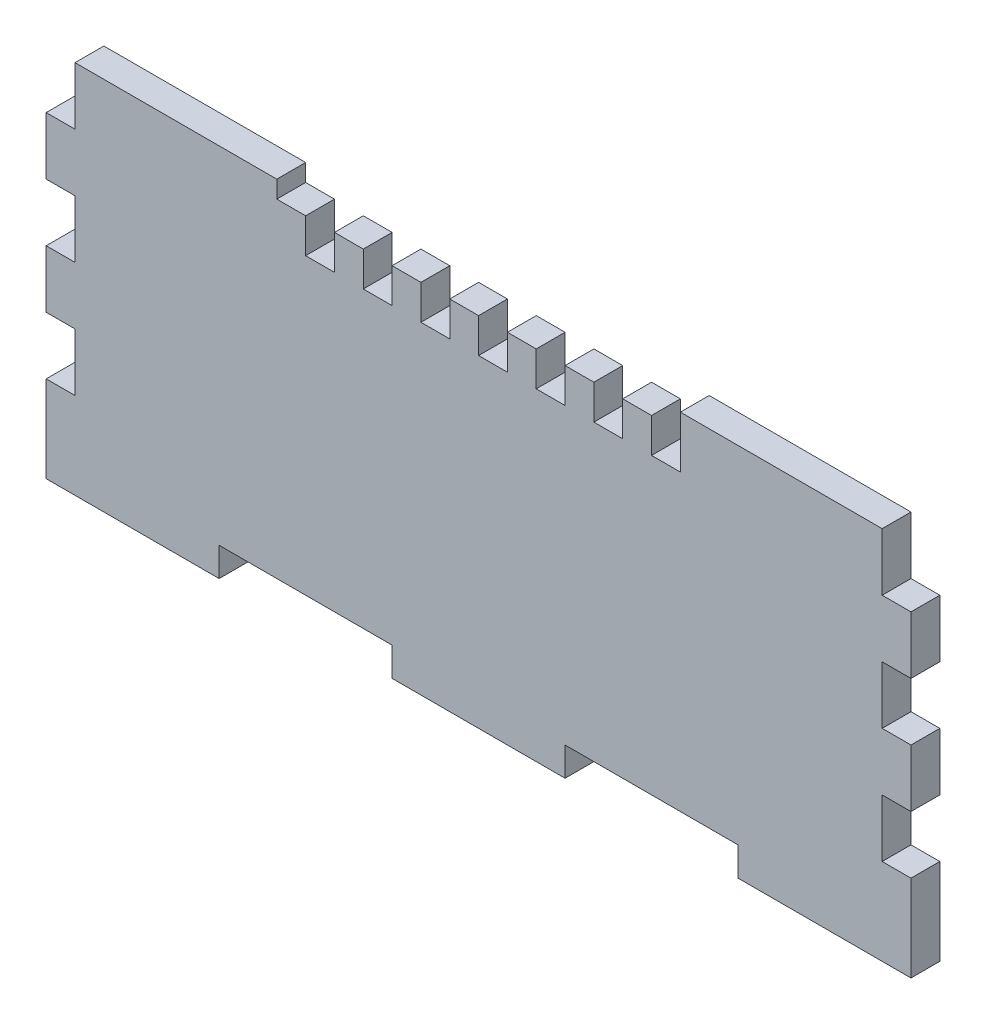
ISO-10303-21;
HEADER;
FILE_DESCRIPTION(('STEP AP214'),'2;1');
FILE_NAME('part.step','',(''),(''),'','','');
FILE_SCHEMA(('AUTOMOTIVE_DESIGN { 1 0 10303 214 1 1 1 1 }'));
ENDSEC;
DATA;
#1=APPLICATION_CONTEXT('core data for automotive mechanical design processes');
#2=APPLICATION_PROTOCOL_DEFINITION('international standard','automotive_design',2000,#1);
#3=PRODUCT_CONTEXT('',#1,'mechanical');
#4=PRODUCT('Part','Part','',(#3));
#5=PRODUCT_RELATED_PRODUCT_CATEGORY('part','',(#4));
#6=PRODUCT_DEFINITION_FORMATION('','',#4);
#7=PRODUCT_DEFINITION_CONTEXT('part definition',#1,'design');
#8=PRODUCT_DEFINITION('design','',#6,#7);
#9=PRODUCT_DEFINITION_SHAPE('','',#8);
#10=(LENGTH_UNIT() NAMED_UNIT(*) SI_UNIT(.MILLI.,.METRE.));
#11=(NAMED_UNIT(*) PLANE_ANGLE_UNIT() SI_UNIT($,.RADIAN.));
#12=(NAMED_UNIT(*) SI_UNIT($,.STERADIAN.) SOLID_ANGLE_UNIT());
#13=UNCERTAINTY_MEASURE_WITH_UNIT(LENGTH_MEASURE(1.E-05),#10,'distance_accuracy_value','');
#14=(GEOMETRIC_REPRESENTATION_CONTEXT(3) GLOBAL_UNCERTAINTY_ASSIGNED_CONTEXT((#13)) GLOBAL_UNIT_ASSIGNED_CONTEXT((#10,
#11,#12)) REPRESENTATION_CONTEXT('',''));
#15=CARTESIAN_POINT('',(0.,0.,0.));
#16=DIRECTION('',(0.,0.,1.));
#17=DIRECTION('',(1.,0.,0.));
#18=AXIS2_PLACEMENT_3D('',#15,#16,#17);
#19=CARTESIAN_POINT('',(0.,152.4,12.7));
#20=DIRECTION('',(0.,0.,-1.));
#21=DIRECTION('',(-1.,0.,0.));
#22=AXIS2_PLACEMENT_3D('',#19,#20,#21);
#23=PLANE('',#22);
#24=DIRECTION('',(0.,-1.,0.));
#25=VECTOR('',#24,1.);
#26=CARTESIAN_POINT('',(139.700000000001,69.8500000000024,12.7));
#27=LINE('',#26,#25);
#28=CARTESIAN_POINT('',(139.7,144.78,12.7));
#29=VERTEX_POINT('',#28);
#30=CARTESIAN_POINT('',(139.7,129.54,12.7));
#31=VERTEX_POINT('',#30);
#32=EDGE_CURVE('E435',#29,#31,#27,.T.);
#33=ORIENTED_EDGE('',*,*,#32,.F.);
#34=DIRECTION('',(-1.,0.,0.));
#35=VECTOR('',#34,1.);
#36=CARTESIAN_POINT('',(55.4542126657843,144.78,12.7));
#37=LINE('',#36,#35);
#38=CARTESIAN_POINT('',(127.,144.78,12.7));
#39=VERTEX_POINT('',#38);
#40=EDGE_CURVE('E422',#29,#39,#37,.T.);
#41=ORIENTED_EDGE('',*,*,#40,.T.);
#42=DIRECTION('',(0.,-1.,0.));
#43=VECTOR('',#42,1.);
#44=CARTESIAN_POINT('',(127.000000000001,69.8500000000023,12.7));
#45=LINE('',#44,#43);
#46=CARTESIAN_POINT('',(127.,129.54,12.7));
#47=VERTEX_POINT('',#46);
#48=EDGE_CURVE('E1460',#39,#47,#45,.T.);
#49=ORIENTED_EDGE('',*,*,#48,.T.);
#50=DIRECTION('',(-1.,0.,0.));
#51=VECTOR('',#50,1.);
#52=CARTESIAN_POINT('',(-132.617428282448,129.54,12.7));
#53=LINE('',#52,#51);
#54=CARTESIAN_POINT('',(114.3,129.54,12.7));
#55=VERTEX_POINT('',#54);
#56=EDGE_CURVE('E1463',#47,#55,#53,.T.);
#57=ORIENTED_EDGE('',*,*,#56,.T.);
#58=DIRECTION('',(0.,-1.,0.));
#59=VECTOR('',#58,1.);
#60=CARTESIAN_POINT('',(114.300000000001,69.8500000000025,12.7));
#61=LINE('',#60,#59);
#62=CARTESIAN_POINT('',(114.3,144.78,12.7));
#63=VERTEX_POINT('',#62);
#64=EDGE_CURVE('E1458',#63,#55,#61,.T.);
#65=ORIENTED_EDGE('',*,*,#64,.F.);
#66=DIRECTION('',(-1.,0.,0.));
#67=VECTOR('',#66,1.);
#68=CARTESIAN_POINT('',(55.4542126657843,144.78,12.7));
#69=LINE('',#68,#67);
#70=CARTESIAN_POINT('',(101.6,144.78,12.7));
#71=VERTEX_POINT('',#70);
#72=EDGE_CURVE('E57',#63,#71,#69,.T.);
#73=ORIENTED_EDGE('',*,*,#72,.T.);
#74=DIRECTION('',(0.,-1.,0.));
#75=VECTOR('',#74,1.);
#76=CARTESIAN_POINT('',(101.6,148.59,12.7));
#77=LINE('',#76,#75);
#78=CARTESIAN_POINT('',(101.6,152.4,12.7));
#79=VERTEX_POINT('',#78);
#80=EDGE_CURVE('E1399',#79,#71,#77,.T.);
#81=ORIENTED_EDGE('',*,*,#80,.F.);
#82=DIRECTION('',(-1.,0.,0.));
#83=VECTOR('',#82,1.);
#84=CARTESIAN_POINT('',(0.,152.4,12.7));
#85=LINE('',#84,#83);
#86=CARTESIAN_POINT('',(12.7,152.4,12.7));
#87=VERTEX_POINT('',#86);
#88=EDGE_CURVE('E805',#79,#87,#85,.T.);
#89=ORIENTED_EDGE('',*,*,#88,.T.);
#90=DIRECTION('',(0.,1.,0.));
#91=VECTOR('',#90,1.);
#92=CARTESIAN_POINT('',(12.7,152.4,12.7));
#93=LINE('',#92,#91);
#94=CARTESIAN_POINT('',(12.7,127.,12.7));
#95=VERTEX_POINT('',#94);
#96=EDGE_CURVE('E666',#95,#87,#93,.T.);
#97=ORIENTED_EDGE('',*,*,#96,.F.);
#98=DIRECTION('',(-1.,0.,0.));
#99=VECTOR('',#98,1.);
#100=CARTESIAN_POINT('',(0.,127.,12.7));
#101=LINE('',#100,#99);
#102=CARTESIAN_POINT('',(0.,127.,12.7));
#103=VERTEX_POINT('',#102);
#104=EDGE_CURVE('E659',#95,#103,#101,.T.);
#105=ORIENTED_EDGE('',*,*,#104,.T.);
#106=DIRECTION('',(0.,-1.,0.));
#107=VECTOR('',#106,1.);
#108=CARTESIAN_POINT('',(0.,0.,12.7));
#109=LINE('',#108,#107);
#110=CARTESIAN_POINT('',(0.,101.6,12.7));
#111=VERTEX_POINT('',#110);
#112=EDGE_CURVE('E731',#103,#111,#109,.T.);
#113=ORIENTED_EDGE('',*,*,#112,.T.);
#114=DIRECTION('',(-1.,0.,0.));
#115=VECTOR('',#114,1.);
#116=CARTESIAN_POINT('',(0.,101.6,12.7));
#117=LINE('',#116,#115);
#118=CARTESIAN_POINT('',(12.7,101.6,12.7));
#119=VERTEX_POINT('',#118);
#120=EDGE_CURVE('E646',#119,#111,#117,.T.);
#121=ORIENTED_EDGE('',*,*,#120,.F.);
#122=DIRECTION('',(0.,1.,0.));
#123=VECTOR('',#122,1.);
#124=CARTESIAN_POINT('',(12.7,152.4,12.7));
#125=LINE('',#124,#123);
#126=CARTESIAN_POINT('',(12.7,76.2,12.7));
#127=VERTEX_POINT('',#126);
#128=EDGE_CURVE('E653',#127,#119,#125,.T.);
#129=ORIENTED_EDGE('',*,*,#128,.F.);
#130=DIRECTION('',(-1.,0.,0.));
#131=VECTOR('',#130,1.);
#132=CARTESIAN_POINT('',(0.,76.2,12.7));
#133=LINE('',#132,#131);
#134=CARTESIAN_POINT('',(0.,76.2,12.7));
#135=VERTEX_POINT('',#134);
#136=EDGE_CURVE('E650',#127,#135,#133,.T.);
#137=ORIENTED_EDGE('',*,*,#136,.T.);
#138=CARTESIAN_POINT('',(0.,50.8,12.7));
#139=VERTEX_POINT('',#138);
#140=EDGE_CURVE('E771',#135,#139,#109,.T.);
#141=ORIENTED_EDGE('',*,*,#140,.T.);
#142=DIRECTION('',(-1.,0.,0.));
#143=VECTOR('',#142,1.);
#144=CARTESIAN_POINT('',(0.,50.8,12.7));
#145=LINE('',#144,#143);
#146=CARTESIAN_POINT('',(12.7,50.8,12.7));
#147=VERTEX_POINT('',#146);
#148=EDGE_CURVE('E628',#147,#139,#145,.T.);
#149=ORIENTED_EDGE('',*,*,#148,.F.);
#150=DIRECTION('',(0.,1.,0.));
#151=VECTOR('',#150,1.);
#152=CARTESIAN_POINT('',(12.7,152.4,12.7));
#153=LINE('',#152,#151);
#154=CARTESIAN_POINT('',(12.7,25.4,12.7));
#155=VERTEX_POINT('',#154);
#156=EDGE_CURVE('E635',#155,#147,#153,.T.);
#157=ORIENTED_EDGE('',*,*,#156,.F.);
#158=DIRECTION('',(-1.,0.,0.));
#159=VECTOR('',#158,1.);
#160=CARTESIAN_POINT('',(0.,25.4,12.7));
#161=LINE('',#160,#159);
#162=CARTESIAN_POINT('',(0.,25.4,12.7));
#163=VERTEX_POINT('',#162);
#164=EDGE_CURVE('E632',#155,#163,#161,.T.);
#165=ORIENTED_EDGE('',*,*,#164,.T.);
#166=CARTESIAN_POINT('',(0.,-12.7,12.7));
#167=VERTEX_POINT('',#166);
#168=EDGE_CURVE('E766',#163,#167,#109,.T.);
#169=ORIENTED_EDGE('',*,*,#168,.T.);
#170=DIRECTION('',(-1.,0.,0.));
#171=VECTOR('',#170,1.);
#172=CARTESIAN_POINT('',(190.5,-12.7,12.7));
#173=LINE('',#172,#171);
#174=CARTESIAN_POINT('',(76.2,-12.7,12.7));
#175=VERTEX_POINT('',#174);
#176=EDGE_CURVE('E722',#175,#167,#173,.T.);
#177=ORIENTED_EDGE('',*,*,#176,.F.);
#178=DIRECTION('',(0.,1.,0.));
#179=VECTOR('',#178,1.);
#180=CARTESIAN_POINT('',(76.2,-12.7,12.7));
#181=LINE('',#180,#179);
#182=CARTESIAN_POINT('',(76.2,0.,12.7));
#183=VERTEX_POINT('',#182);
#184=EDGE_CURVE('E728',#175,#183,#181,.T.);
#185=ORIENTED_EDGE('',*,*,#184,.T.);
#186=DIRECTION('',(1.,0.,0.));
#187=VECTOR('',#186,1.);
#188=CARTESIAN_POINT('',(0.,0.,12.7));
#189=LINE('',#188,#187);
#190=CARTESIAN_POINT('',(152.4,0.,12.7));
#191=VERTEX_POINT('',#190);
#192=EDGE_CURVE('E737',#183,#191,#189,.T.);
#193=ORIENTED_EDGE('',*,*,#192,.T.);
#194=DIRECTION('',(0.,1.,0.));
#195=VECTOR('',#194,1.);
#196=CARTESIAN_POINT('',(152.4,-12.7,12.7));
#197=LINE('',#196,#195);
#198=CARTESIAN_POINT('',(152.4,-12.7,12.7));
#199=VERTEX_POINT('',#198);
#200=EDGE_CURVE('E710',#199,#191,#197,.T.);
#201=ORIENTED_EDGE('',*,*,#200,.F.);
#202=DIRECTION('',(-1.,0.,0.));
#203=VECTOR('',#202,1.);
#204=CARTESIAN_POINT('',(190.5,-12.7,12.7));
#205=LINE('',#204,#203);
#206=CARTESIAN_POINT('',(228.6,-12.7,12.7));
#207=VERTEX_POINT('',#206);
#208=EDGE_CURVE('E693',#207,#199,#205,.T.);
#209=ORIENTED_EDGE('',*,*,#208,.F.);
#210=DIRECTION('',(0.,1.,0.));
#211=VECTOR('',#210,1.);
#212=CARTESIAN_POINT('',(228.6,-12.7,12.7));
#213=LINE('',#212,#211);
#214=CARTESIAN_POINT('',(228.6,0.,12.7));
#215=VERTEX_POINT('',#214);
#216=EDGE_CURVE('E713',#207,#215,#213,.T.);
#217=ORIENTED_EDGE('',*,*,#216,.T.);
#218=CARTESIAN_POINT('',(304.8,0.,12.7));
#219=VERTEX_POINT('',#218);
#220=EDGE_CURVE('E754',#215,#219,#189,.T.);
#221=ORIENTED_EDGE('',*,*,#220,.T.);
#222=DIRECTION('',(0.,1.,0.));
#223=VECTOR('',#222,1.);
#224=CARTESIAN_POINT('',(304.8,-12.7,12.7));
#225=LINE('',#224,#223);
#226=CARTESIAN_POINT('',(304.8,-12.7,12.7));
#227=VERTEX_POINT('',#226);
#228=EDGE_CURVE('E686',#227,#219,#225,.T.);
#229=ORIENTED_EDGE('',*,*,#228,.F.);
#230=DIRECTION('',(-1.,0.,0.));
#231=VECTOR('',#230,1.);
#232=CARTESIAN_POINT('',(190.5,-12.7,12.7));
#233=LINE('',#232,#231);
#234=CARTESIAN_POINT('',(381.,-12.7,12.7));
#235=VERTEX_POINT('',#234);
#236=EDGE_CURVE('E670',#235,#227,#233,.T.);
#237=ORIENTED_EDGE('',*,*,#236,.F.);
#238=DIRECTION('',(0.,1.,0.));
#239=VECTOR('',#238,1.);
#240=CARTESIAN_POINT('',(381.,0.,12.7));
#241=LINE('',#240,#239);
#242=CARTESIAN_POINT('',(381.,25.4,12.7));
#243=VERTEX_POINT('',#242);
#244=EDGE_CURVE('E807',#235,#243,#241,.T.);
#245=ORIENTED_EDGE('',*,*,#244,.T.);
#246=DIRECTION('',(-1.,0.,0.));
#247=VECTOR('',#246,1.);
#248=CARTESIAN_POINT('',(0.,25.4,12.7));
#249=LINE('',#248,#247);
#250=CARTESIAN_POINT('',(368.3,25.4,12.7));
#251=VERTEX_POINT('',#250);
#252=EDGE_CURVE('E608',#243,#251,#249,.T.);
#253=ORIENTED_EDGE('',*,*,#252,.T.);
#254=DIRECTION('',(0.,1.,0.));
#255=VECTOR('',#254,1.);
#256=CARTESIAN_POINT('',(368.3,152.4,12.7));
#257=LINE('',#256,#255);
#258=CARTESIAN_POINT('',(368.3,50.8,12.7));
#259=VERTEX_POINT('',#258);
#260=EDGE_CURVE('E616',#251,#259,#257,.T.);
#261=ORIENTED_EDGE('',*,*,#260,.T.);
#262=DIRECTION('',(-1.,0.,0.));
#263=VECTOR('',#262,1.);
#264=CARTESIAN_POINT('',(0.,50.8,12.7));
#265=LINE('',#264,#263);
#266=CARTESIAN_POINT('',(381.,50.8,12.7));
#267=VERTEX_POINT('',#266);
#268=EDGE_CURVE('E614',#267,#259,#265,.T.);
#269=ORIENTED_EDGE('',*,*,#268,.F.);
#270=CARTESIAN_POINT('',(381.,76.2,12.7));
#271=VERTEX_POINT('',#270);
#272=EDGE_CURVE('E810',#267,#271,#241,.T.);
#273=ORIENTED_EDGE('',*,*,#272,.T.);
#274=DIRECTION('',(-1.,0.,0.));
#275=VECTOR('',#274,1.);
#276=CARTESIAN_POINT('',(0.,76.2,12.7));
#277=LINE('',#276,#275);
#278=CARTESIAN_POINT('',(368.3,76.2,12.7));
#279=VERTEX_POINT('',#278);
#280=EDGE_CURVE('E589',#271,#279,#277,.T.);
#281=ORIENTED_EDGE('',*,*,#280,.T.);
#282=DIRECTION('',(0.,1.,0.));
#283=VECTOR('',#282,1.);
#284=CARTESIAN_POINT('',(368.3,152.4,12.7));
#285=LINE('',#284,#283);
#286=CARTESIAN_POINT('',(368.3,101.6,12.7));
#287=VERTEX_POINT('',#286);
#288=EDGE_CURVE('E597',#279,#287,#285,.T.);
#289=ORIENTED_EDGE('',*,*,#288,.T.);
#290=DIRECTION('',(-1.,0.,0.));
#291=VECTOR('',#290,1.);
#292=CARTESIAN_POINT('',(0.,101.6,12.7));
#293=LINE('',#292,#291);
#294=CARTESIAN_POINT('',(381.,101.6,12.7));
#295=VERTEX_POINT('',#294);
#296=EDGE_CURVE('E595',#295,#287,#293,.T.);
#297=ORIENTED_EDGE('',*,*,#296,.F.);
#298=CARTESIAN_POINT('',(381.,127.,12.7));
#299=VERTEX_POINT('',#298);
#300=EDGE_CURVE('E811',#295,#299,#241,.T.);
#301=ORIENTED_EDGE('',*,*,#300,.T.);
#302=DIRECTION('',(-1.,0.,0.));
#303=VECTOR('',#302,1.);
#304=CARTESIAN_POINT('',(0.,127.,12.7));
#305=LINE('',#304,#303);
#306=CARTESIAN_POINT('',(368.3,127.,12.7));
#307=VERTEX_POINT('',#306);
#308=EDGE_CURVE('E578',#299,#307,#305,.T.);
#309=ORIENTED_EDGE('',*,*,#308,.T.);
#310=DIRECTION('',(0.,1.,0.));
#311=VECTOR('',#310,1.);
#312=CARTESIAN_POINT('',(368.3,152.4,12.7));
#313=LINE('',#312,#311);
#314=CARTESIAN_POINT('',(368.3,152.4,12.7));
#315=VERTEX_POINT('',#314);
#316=EDGE_CURVE('E573',#307,#315,#313,.T.);
#317=ORIENTED_EDGE('',*,*,#316,.T.);
#318=CARTESIAN_POINT('',(279.4,152.4,12.7));
#319=VERTEX_POINT('',#318);
#320=EDGE_CURVE('E802',#315,#319,#85,.T.);
#321=ORIENTED_EDGE('',*,*,#320,.T.);
#322=DIRECTION('',(0.,-1.,0.));
#323=VECTOR('',#322,1.);
#324=CARTESIAN_POINT('',(279.4,69.850000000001,12.7));
#325=LINE('',#324,#323);
#326=CARTESIAN_POINT('',(279.4,129.54,12.7));
#327=VERTEX_POINT('',#326);
#328=EDGE_CURVE('E545',#319,#327,#325,.T.);
#329=ORIENTED_EDGE('',*,*,#328,.T.);
#330=DIRECTION('',(-1.,0.,0.));
#331=VECTOR('',#330,1.);
#332=CARTESIAN_POINT('',(-132.617428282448,129.54,12.7));
#333=LINE('',#332,#331);
#334=CARTESIAN_POINT('',(266.7,129.54,12.7));
#335=VERTEX_POINT('',#334);
#336=EDGE_CURVE('E549',#327,#335,#333,.T.);
#337=ORIENTED_EDGE('',*,*,#336,.T.);
#338=DIRECTION('',(0.,-1.,0.));
#339=VECTOR('',#338,1.);
#340=CARTESIAN_POINT('',(266.7,69.850000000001,12.7));
#341=LINE('',#340,#339);
#342=CARTESIAN_POINT('',(266.7,144.78,12.7));
#343=VERTEX_POINT('',#342);
#344=EDGE_CURVE('E543',#343,#335,#341,.T.);
#345=ORIENTED_EDGE('',*,*,#344,.F.);
#346=DIRECTION('',(-1.,0.,0.));
#347=VECTOR('',#346,1.);
#348=CARTESIAN_POINT('',(55.4542126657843,144.78,12.7));
#349=LINE('',#348,#347);
#350=CARTESIAN_POINT('',(254.,144.78,12.7));
#351=VERTEX_POINT('',#350);
#352=EDGE_CURVE('E1448',#343,#351,#349,.T.);
#353=ORIENTED_EDGE('',*,*,#352,.T.);
#354=DIRECTION('',(0.,-1.,0.));
#355=VECTOR('',#354,1.);
#356=CARTESIAN_POINT('',(254.,69.8500000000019,12.7));
#357=LINE('',#356,#355);
#358=CARTESIAN_POINT('',(254.,129.54,12.7));
#359=VERTEX_POINT('',#358);
#360=EDGE_CURVE('E525',#351,#359,#357,.T.);
#361=ORIENTED_EDGE('',*,*,#360,.T.);
#362=DIRECTION('',(-1.,0.,0.));
#363=VECTOR('',#362,1.);
#364=CARTESIAN_POINT('',(-132.617428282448,129.54,12.7));
#365=LINE('',#364,#363);
#366=CARTESIAN_POINT('',(241.3,129.54,12.7));
#367=VERTEX_POINT('',#366);
#368=EDGE_CURVE('E528',#359,#367,#365,.T.);
#369=ORIENTED_EDGE('',*,*,#368,.T.);
#370=DIRECTION('',(0.,-1.,0.));
#371=VECTOR('',#370,1.);
#372=CARTESIAN_POINT('',(241.3,69.8500000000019,12.7));
#373=LINE('',#372,#371);
#374=CARTESIAN_POINT('',(241.3,144.78,12.7));
#375=VERTEX_POINT('',#374);
#376=EDGE_CURVE('E523',#375,#367,#373,.T.);
#377=ORIENTED_EDGE('',*,*,#376,.F.);
#378=DIRECTION('',(-1.,0.,0.));
#379=VECTOR('',#378,1.);
#380=CARTESIAN_POINT('',(55.4542126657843,144.78,12.7));
#381=LINE('',#380,#379);
#382=CARTESIAN_POINT('',(228.6,144.78,12.7));
#383=VERTEX_POINT('',#382);
#384=EDGE_CURVE('E1438',#375,#383,#381,.T.);
#385=ORIENTED_EDGE('',*,*,#384,.T.);
#386=DIRECTION('',(0.,-1.,0.));
#387=VECTOR('',#386,1.);
#388=CARTESIAN_POINT('',(228.6,69.8500000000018,12.7));
#389=LINE('',#388,#387);
#390=CARTESIAN_POINT('',(228.6,129.54,12.7));
#391=VERTEX_POINT('',#390);
#392=EDGE_CURVE('E505',#383,#391,#389,.T.);
#393=ORIENTED_EDGE('',*,*,#392,.T.);
#394=DIRECTION('',(-1.,0.,0.));
#395=VECTOR('',#394,1.);
#396=CARTESIAN_POINT('',(-132.617428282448,129.54,12.7));
#397=LINE('',#396,#395);
#398=CARTESIAN_POINT('',(215.9,129.54,12.7));
#399=VERTEX_POINT('',#398);
#400=EDGE_CURVE('E508',#391,#399,#397,.T.);
#401=ORIENTED_EDGE('',*,*,#400,.T.);
#402=DIRECTION('',(0.,-1.,0.));
#403=VECTOR('',#402,1.);
#404=CARTESIAN_POINT('',(215.9,69.8500000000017,12.7));
#405=LINE('',#404,#403);
#406=CARTESIAN_POINT('',(215.9,144.78,12.7));
#407=VERTEX_POINT('',#406);
#408=EDGE_CURVE('E503',#407,#399,#405,.T.);
#409=ORIENTED_EDGE('',*,*,#408,.F.);
#410=DIRECTION('',(-1.,0.,0.));
#411=VECTOR('',#410,1.);
#412=CARTESIAN_POINT('',(55.4542126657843,144.78,12.7));
#413=LINE('',#412,#411);
#414=CARTESIAN_POINT('',(203.2,144.78,12.7));
#415=VERTEX_POINT('',#414);
#416=EDGE_CURVE('E1428',#407,#415,#413,.T.);
#417=ORIENTED_EDGE('',*,*,#416,.T.);
#418=DIRECTION('',(0.,-1.,0.));
#419=VECTOR('',#418,1.);
#420=CARTESIAN_POINT('',(203.200000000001,69.8500000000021,12.7));
#421=LINE('',#420,#419);
#422=CARTESIAN_POINT('',(203.2,129.54,12.7));
#423=VERTEX_POINT('',#422);
#424=EDGE_CURVE('E485',#415,#423,#421,.T.);
#425=ORIENTED_EDGE('',*,*,#424,.T.);
#426=DIRECTION('',(-1.,0.,0.));
#427=VECTOR('',#426,1.);
#428=CARTESIAN_POINT('',(-132.617428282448,129.54,12.7));
#429=LINE('',#428,#427);
#430=CARTESIAN_POINT('',(190.5,129.54,12.7));
#431=VERTEX_POINT('',#430);
#432=EDGE_CURVE('E488',#423,#431,#429,.T.);
#433=ORIENTED_EDGE('',*,*,#432,.T.);
#434=DIRECTION('',(0.,-1.,0.));
#435=VECTOR('',#434,1.);
#436=CARTESIAN_POINT('',(190.500000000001,69.850000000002,12.7));
#437=LINE('',#436,#435);
#438=CARTESIAN_POINT('',(190.5,144.78,12.7));
#439=VERTEX_POINT('',#438);
#440=EDGE_CURVE('E483',#439,#431,#437,.T.);
#441=ORIENTED_EDGE('',*,*,#440,.F.);
#442=DIRECTION('',(-1.,0.,0.));
#443=VECTOR('',#442,1.);
#444=CARTESIAN_POINT('',(55.4542126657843,144.78,12.7));
#445=LINE('',#444,#443);
#446=CARTESIAN_POINT('',(177.8,144.78,12.7));
#447=VERTEX_POINT('',#446);
#448=EDGE_CURVE('E1418',#439,#447,#445,.T.);
#449=ORIENTED_EDGE('',*,*,#448,.T.);
#450=DIRECTION('',(0.,-1.,0.));
#451=VECTOR('',#450,1.);
#452=CARTESIAN_POINT('',(177.800000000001,69.8500000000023,12.7));
#453=LINE('',#452,#451);
#454=CARTESIAN_POINT('',(177.8,129.54,12.7));
#455=VERTEX_POINT('',#454);
#456=EDGE_CURVE('E465',#447,#455,#453,.T.);
#457=ORIENTED_EDGE('',*,*,#456,.T.);
#458=DIRECTION('',(-1.,0.,0.));
#459=VECTOR('',#458,1.);
#460=CARTESIAN_POINT('',(-132.617428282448,129.54,12.7));
#461=LINE('',#460,#459);
#462=CARTESIAN_POINT('',(165.1,129.54,12.7));
#463=VERTEX_POINT('',#462);
#464=EDGE_CURVE('E468',#455,#463,#461,.T.);
#465=ORIENTED_EDGE('',*,*,#464,.T.);
#466=DIRECTION('',(0.,-1.,0.));
#467=VECTOR('',#466,1.);
#468=CARTESIAN_POINT('',(165.100000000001,69.8500000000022,12.7));
#469=LINE('',#468,#467);
#470=CARTESIAN_POINT('',(165.1,144.78,12.7));
#471=VERTEX_POINT('',#470);
#472=EDGE_CURVE('E463',#471,#463,#469,.T.);
#473=ORIENTED_EDGE('',*,*,#472,.F.);
#474=DIRECTION('',(-1.,0.,0.));
#475=VECTOR('',#474,1.);
#476=CARTESIAN_POINT('',(55.4542126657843,144.78,12.7));
#477=LINE('',#476,#475);
#478=CARTESIAN_POINT('',(152.4,144.78,12.7));
#479=VERTEX_POINT('',#478);
#480=EDGE_CURVE('E1408',#471,#479,#477,.T.);
#481=ORIENTED_EDGE('',*,*,#480,.T.);
#482=DIRECTION('',(0.,-1.,0.));
#483=VECTOR('',#482,1.);
#484=CARTESIAN_POINT('',(152.400000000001,69.8500000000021,12.7));
#485=LINE('',#484,#483);
#486=CARTESIAN_POINT('',(152.4,129.54,12.7));
#487=VERTEX_POINT('',#486);
#488=EDGE_CURVE('E442',#479,#487,#485,.T.);
#489=ORIENTED_EDGE('',*,*,#488,.T.);
#490=DIRECTION('',(-1.,0.,0.));
#491=VECTOR('',#490,1.);
#492=CARTESIAN_POINT('',(-132.617428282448,129.54,12.7));
#493=LINE('',#492,#491);
#494=EDGE_CURVE('E441',#487,#31,#493,.T.);
#495=ORIENTED_EDGE('',*,*,#494,.T.);
#496=EDGE_LOOP('',(#33,#41,#49,#57,#65,#73,#81,#89,#97,#105,#113,#121,#129,#137,#141,#149,#157,
#165,#169,#177,#185,#193,#201,#209,#217,#221,#229,#237,#245,#253,#261,#269,#273,#281,#289,#297,
#301,#309,#317,#321,#329,#337,#345,#353,#361,#369,#377,#385,#393,#401,#409,#417,#425,#433,#441,
#449,#457,#465,#473,#481,#489,#495));
#497=FACE_BOUND('',#496,.T.);
#498=ADVANCED_FACE('F34',(#497),#23,.F.);
#499=CARTESIAN_POINT('',(0.,152.4,0.));
#500=DIRECTION('',(0.,0.,-1.));
#501=DIRECTION('',(-1.,0.,0.));
#502=AXIS2_PLACEMENT_3D('',#499,#500,#501);
#503=PLANE('',#502);
#504=DIRECTION('',(-1.,0.,0.));
#505=VECTOR('',#504,1.);
#506=CARTESIAN_POINT('',(55.4542126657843,144.78,0.));
#507=LINE('',#506,#505);
#508=CARTESIAN_POINT('',(139.7,144.78,0.));
#509=VERTEX_POINT('',#508);
#510=CARTESIAN_POINT('',(127.,144.78,0.));
#511=VERTEX_POINT('',#510);
#512=EDGE_CURVE('E49',#509,#511,#507,.T.);
#513=ORIENTED_EDGE('',*,*,#512,.F.);
#514=DIRECTION('',(0.,-1.,0.));
#515=VECTOR('',#514,1.);
#516=CARTESIAN_POINT('',(139.700000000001,69.8500000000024,0.));
#517=LINE('',#516,#515);
#518=CARTESIAN_POINT('',(139.7,129.54,0.));
#519=VERTEX_POINT('',#518);
#520=EDGE_CURVE('E437',#509,#519,#517,.T.);
#521=ORIENTED_EDGE('',*,*,#520,.T.);
#522=DIRECTION('',(-1.,0.,0.));
#523=VECTOR('',#522,1.);
#524=CARTESIAN_POINT('',(-132.617428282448,129.54,0.));
#525=LINE('',#524,#523);
#526=CARTESIAN_POINT('',(152.4,129.54,0.));
#527=VERTEX_POINT('',#526);
#528=EDGE_CURVE('E443',#527,#519,#525,.T.);
#529=ORIENTED_EDGE('',*,*,#528,.F.);
#530=DIRECTION('',(0.,-1.,0.));
#531=VECTOR('',#530,1.);
#532=CARTESIAN_POINT('',(152.400000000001,69.8500000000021,0.));
#533=LINE('',#532,#531);
#534=CARTESIAN_POINT('',(152.4,144.78,0.));
#535=VERTEX_POINT('',#534);
#536=EDGE_CURVE('E447',#535,#527,#533,.T.);
#537=ORIENTED_EDGE('',*,*,#536,.F.);
#538=DIRECTION('',(-1.,0.,0.));
#539=VECTOR('',#538,1.);
#540=CARTESIAN_POINT('',(55.4542126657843,144.78,0.));
#541=LINE('',#540,#539);
#542=CARTESIAN_POINT('',(165.1,144.78,0.));
#543=VERTEX_POINT('',#542);
#544=EDGE_CURVE('E1406',#543,#535,#541,.T.);
#545=ORIENTED_EDGE('',*,*,#544,.F.);
#546=DIRECTION('',(0.,-1.,0.));
#547=VECTOR('',#546,1.);
#548=CARTESIAN_POINT('',(165.100000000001,69.8500000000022,0.));
#549=LINE('',#548,#547);
#550=CARTESIAN_POINT('',(165.1,129.54,0.));
#551=VERTEX_POINT('',#550);
#552=EDGE_CURVE('E460',#543,#551,#549,.T.);
#553=ORIENTED_EDGE('',*,*,#552,.T.);
#554=DIRECTION('',(-1.,0.,0.));
#555=VECTOR('',#554,1.);
#556=CARTESIAN_POINT('',(-132.617428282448,129.54,0.));
#557=LINE('',#556,#555);
#558=CARTESIAN_POINT('',(177.8,129.54,0.));
#559=VERTEX_POINT('',#558);
#560=EDGE_CURVE('E466',#559,#551,#557,.T.);
#561=ORIENTED_EDGE('',*,*,#560,.F.);
#562=DIRECTION('',(0.,-1.,0.));
#563=VECTOR('',#562,1.);
#564=CARTESIAN_POINT('',(177.800000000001,69.8500000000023,0.));
#565=LINE('',#564,#563);
#566=CARTESIAN_POINT('',(177.8,144.78,0.));
#567=VERTEX_POINT('',#566);
#568=EDGE_CURVE('E473',#567,#559,#565,.T.);
#569=ORIENTED_EDGE('',*,*,#568,.F.);
#570=DIRECTION('',(-1.,0.,0.));
#571=VECTOR('',#570,1.);
#572=CARTESIAN_POINT('',(55.4542126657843,144.78,0.));
#573=LINE('',#572,#571);
#574=CARTESIAN_POINT('',(190.5,144.78,0.));
#575=VERTEX_POINT('',#574);
#576=EDGE_CURVE('E1416',#575,#567,#573,.T.);
#577=ORIENTED_EDGE('',*,*,#576,.F.);
#578=DIRECTION('',(0.,-1.,0.));
#579=VECTOR('',#578,1.);
#580=CARTESIAN_POINT('',(190.500000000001,69.850000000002,0.));
#581=LINE('',#580,#579);
#582=CARTESIAN_POINT('',(190.5,129.54,0.));
#583=VERTEX_POINT('',#582);
#584=EDGE_CURVE('E480',#575,#583,#581,.T.);
#585=ORIENTED_EDGE('',*,*,#584,.T.);
#586=DIRECTION('',(-1.,0.,0.));
#587=VECTOR('',#586,1.);
#588=CARTESIAN_POINT('',(-132.617428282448,129.54,0.));
#589=LINE('',#588,#587);
#590=CARTESIAN_POINT('',(203.2,129.54,0.));
#591=VERTEX_POINT('',#590);
#592=EDGE_CURVE('E486',#591,#583,#589,.T.);
#593=ORIENTED_EDGE('',*,*,#592,.F.);
#594=DIRECTION('',(0.,-1.,0.));
#595=VECTOR('',#594,1.);
#596=CARTESIAN_POINT('',(203.200000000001,69.8500000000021,0.));
#597=LINE('',#596,#595);
#598=CARTESIAN_POINT('',(203.2,144.78,0.));
#599=VERTEX_POINT('',#598);
#600=EDGE_CURVE('E493',#599,#591,#597,.T.);
#601=ORIENTED_EDGE('',*,*,#600,.F.);
#602=DIRECTION('',(-1.,0.,0.));
#603=VECTOR('',#602,1.);
#604=CARTESIAN_POINT('',(55.4542126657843,144.78,0.));
#605=LINE('',#604,#603);
#606=CARTESIAN_POINT('',(215.9,144.78,0.));
#607=VERTEX_POINT('',#606);
#608=EDGE_CURVE('E1426',#607,#599,#605,.T.);
#609=ORIENTED_EDGE('',*,*,#608,.F.);
#610=DIRECTION('',(0.,-1.,0.));
#611=VECTOR('',#610,1.);
#612=CARTESIAN_POINT('',(215.9,69.8500000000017,0.));
#613=LINE('',#612,#611);
#614=CARTESIAN_POINT('',(215.9,129.54,0.));
#615=VERTEX_POINT('',#614);
#616=EDGE_CURVE('E500',#607,#615,#613,.T.);
#617=ORIENTED_EDGE('',*,*,#616,.T.);
#618=DIRECTION('',(-1.,0.,0.));
#619=VECTOR('',#618,1.);
#620=CARTESIAN_POINT('',(-132.617428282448,129.54,0.));
#621=LINE('',#620,#619);
#622=CARTESIAN_POINT('',(228.6,129.54,0.));
#623=VERTEX_POINT('',#622);
#624=EDGE_CURVE('E506',#623,#615,#621,.T.);
#625=ORIENTED_EDGE('',*,*,#624,.F.);
#626=DIRECTION('',(0.,-1.,0.));
#627=VECTOR('',#626,1.);
#628=CARTESIAN_POINT('',(228.6,69.8500000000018,0.));
#629=LINE('',#628,#627);
#630=CARTESIAN_POINT('',(228.6,144.78,0.));
#631=VERTEX_POINT('',#630);
#632=EDGE_CURVE('E513',#631,#623,#629,.T.);
#633=ORIENTED_EDGE('',*,*,#632,.F.);
#634=DIRECTION('',(-1.,0.,0.));
#635=VECTOR('',#634,1.);
#636=CARTESIAN_POINT('',(55.4542126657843,144.78,0.));
#637=LINE('',#636,#635);
#638=CARTESIAN_POINT('',(241.3,144.78,0.));
#639=VERTEX_POINT('',#638);
#640=EDGE_CURVE('E1436',#639,#631,#637,.T.);
#641=ORIENTED_EDGE('',*,*,#640,.F.);
#642=DIRECTION('',(0.,-1.,0.));
#643=VECTOR('',#642,1.);
#644=CARTESIAN_POINT('',(241.3,69.8500000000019,0.));
#645=LINE('',#644,#643);
#646=CARTESIAN_POINT('',(241.3,129.54,0.));
#647=VERTEX_POINT('',#646);
#648=EDGE_CURVE('E520',#639,#647,#645,.T.);
#649=ORIENTED_EDGE('',*,*,#648,.T.);
#650=DIRECTION('',(-1.,0.,0.));
#651=VECTOR('',#650,1.);
#652=CARTESIAN_POINT('',(-132.617428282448,129.54,0.));
#653=LINE('',#652,#651);
#654=CARTESIAN_POINT('',(254.,129.54,0.));
#655=VERTEX_POINT('',#654);
#656=EDGE_CURVE('E526',#655,#647,#653,.T.);
#657=ORIENTED_EDGE('',*,*,#656,.F.);
#658=DIRECTION('',(0.,-1.,0.));
#659=VECTOR('',#658,1.);
#660=CARTESIAN_POINT('',(254.,69.8500000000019,0.));
#661=LINE('',#660,#659);
#662=CARTESIAN_POINT('',(254.,144.78,0.));
#663=VERTEX_POINT('',#662);
#664=EDGE_CURVE('E533',#663,#655,#661,.T.);
#665=ORIENTED_EDGE('',*,*,#664,.F.);
#666=DIRECTION('',(-1.,0.,0.));
#667=VECTOR('',#666,1.);
#668=CARTESIAN_POINT('',(55.4542126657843,144.78,0.));
#669=LINE('',#668,#667);
#670=CARTESIAN_POINT('',(266.7,144.78,0.));
#671=VERTEX_POINT('',#670);
#672=EDGE_CURVE('E1446',#671,#663,#669,.T.);
#673=ORIENTED_EDGE('',*,*,#672,.F.);
#674=DIRECTION('',(0.,-1.,0.));
#675=VECTOR('',#674,1.);
#676=CARTESIAN_POINT('',(266.7,69.850000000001,0.));
#677=LINE('',#676,#675);
#678=CARTESIAN_POINT('',(266.7,129.54,0.));
#679=VERTEX_POINT('',#678);
#680=EDGE_CURVE('E540',#671,#679,#677,.T.);
#681=ORIENTED_EDGE('',*,*,#680,.T.);
#682=DIRECTION('',(-1.,0.,0.));
#683=VECTOR('',#682,1.);
#684=CARTESIAN_POINT('',(-132.617428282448,129.54,0.));
#685=LINE('',#684,#683);
#686=CARTESIAN_POINT('',(279.4,129.54,0.));
#687=VERTEX_POINT('',#686);
#688=EDGE_CURVE('E546',#687,#679,#685,.T.);
#689=ORIENTED_EDGE('',*,*,#688,.F.);
#690=DIRECTION('',(0.,-1.,0.));
#691=VECTOR('',#690,1.);
#692=CARTESIAN_POINT('',(279.4,69.850000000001,0.));
#693=LINE('',#692,#691);
#694=CARTESIAN_POINT('',(279.4,152.4,0.));
#695=VERTEX_POINT('',#694);
#696=EDGE_CURVE('E554',#695,#687,#693,.T.);
#697=ORIENTED_EDGE('',*,*,#696,.F.);
#698=DIRECTION('',(-1.,0.,0.));
#699=VECTOR('',#698,1.);
#700=CARTESIAN_POINT('',(0.,152.4,0.));
#701=LINE('',#700,#699);
#702=CARTESIAN_POINT('',(368.3,152.4,0.));
#703=VERTEX_POINT('',#702);
#704=EDGE_CURVE('E764',#703,#695,#701,.T.);
#705=ORIENTED_EDGE('',*,*,#704,.F.);
#706=DIRECTION('',(0.,1.,0.));
#707=VECTOR('',#706,1.);
#708=CARTESIAN_POINT('',(368.3,152.4,0.));
#709=LINE('',#708,#707);
#710=CARTESIAN_POINT('',(368.3,127.,0.));
#711=VERTEX_POINT('',#710);
#712=EDGE_CURVE('E569',#711,#703,#709,.T.);
#713=ORIENTED_EDGE('',*,*,#712,.F.);
#714=DIRECTION('',(-1.,0.,0.));
#715=VECTOR('',#714,1.);
#716=CARTESIAN_POINT('',(0.,127.,0.));
#717=LINE('',#716,#715);
#718=CARTESIAN_POINT('',(381.,127.,0.));
#719=VERTEX_POINT('',#718);
#720=EDGE_CURVE('E576',#719,#711,#717,.T.);
#721=ORIENTED_EDGE('',*,*,#720,.F.);
#722=DIRECTION('',(0.,1.,0.));
#723=VECTOR('',#722,1.);
#724=CARTESIAN_POINT('',(381.,0.,0.));
#725=LINE('',#724,#723);
#726=CARTESIAN_POINT('',(381.,101.6,0.));
#727=VERTEX_POINT('',#726);
#728=EDGE_CURVE('E763',#727,#719,#725,.T.);
#729=ORIENTED_EDGE('',*,*,#728,.F.);
#730=DIRECTION('',(-1.,0.,0.));
#731=VECTOR('',#730,1.);
#732=CARTESIAN_POINT('',(0.,101.6,0.));
#733=LINE('',#732,#731);
#734=CARTESIAN_POINT('',(368.3,101.6,0.));
#735=VERTEX_POINT('',#734);
#736=EDGE_CURVE('E592',#727,#735,#733,.T.);
#737=ORIENTED_EDGE('',*,*,#736,.T.);
#738=DIRECTION('',(0.,1.,0.));
#739=VECTOR('',#738,1.);
#740=CARTESIAN_POINT('',(368.3,152.4,0.));
#741=LINE('',#740,#739);
#742=CARTESIAN_POINT('',(368.3,76.2,0.));
#743=VERTEX_POINT('',#742);
#744=EDGE_CURVE('E42',#743,#735,#741,.T.);
#745=ORIENTED_EDGE('',*,*,#744,.F.);
#746=DIRECTION('',(-1.,0.,0.));
#747=VECTOR('',#746,1.);
#748=CARTESIAN_POINT('',(0.,76.2,0.));
#749=LINE('',#748,#747);
#750=CARTESIAN_POINT('',(381.,76.2,0.));
#751=VERTEX_POINT('',#750);
#752=EDGE_CURVE('E585',#751,#743,#749,.T.);
#753=ORIENTED_EDGE('',*,*,#752,.F.);
#754=CARTESIAN_POINT('',(381.,50.8,0.));
#755=VERTEX_POINT('',#754);
#756=EDGE_CURVE('E777',#755,#751,#725,.T.);
#757=ORIENTED_EDGE('',*,*,#756,.F.);
#758=DIRECTION('',(-1.,0.,0.));
#759=VECTOR('',#758,1.);
#760=CARTESIAN_POINT('',(0.,50.8,0.));
#761=LINE('',#760,#759);
#762=CARTESIAN_POINT('',(368.3,50.8,0.));
#763=VERTEX_POINT('',#762);
#764=EDGE_CURVE('E611',#755,#763,#761,.T.);
#765=ORIENTED_EDGE('',*,*,#764,.T.);
#766=DIRECTION('',(0.,1.,0.));
#767=VECTOR('',#766,1.);
#768=CARTESIAN_POINT('',(368.3,152.4,0.));
#769=LINE('',#768,#767);
#770=CARTESIAN_POINT('',(368.3,25.4,0.));
#771=VERTEX_POINT('',#770);
#772=EDGE_CURVE('E855',#771,#763,#769,.T.);
#773=ORIENTED_EDGE('',*,*,#772,.F.);
#774=DIRECTION('',(-1.,0.,0.));
#775=VECTOR('',#774,1.);
#776=CARTESIAN_POINT('',(0.,25.4,0.));
#777=LINE('',#776,#775);
#778=CARTESIAN_POINT('',(381.,25.4,0.));
#779=VERTEX_POINT('',#778);
#780=EDGE_CURVE('E604',#779,#771,#777,.T.);
#781=ORIENTED_EDGE('',*,*,#780,.F.);
#782=CARTESIAN_POINT('',(381.,-12.7,0.));
#783=VERTEX_POINT('',#782);
#784=EDGE_CURVE('E760',#783,#779,#725,.T.);
#785=ORIENTED_EDGE('',*,*,#784,.F.);
#786=DIRECTION('',(1.,0.,0.));
#787=VECTOR('',#786,1.);
#788=CARTESIAN_POINT('',(190.5,-12.7,0.));
#789=LINE('',#788,#787);
#790=CARTESIAN_POINT('',(304.8,-12.7,0.));
#791=VERTEX_POINT('',#790);
#792=EDGE_CURVE('E675',#791,#783,#789,.T.);
#793=ORIENTED_EDGE('',*,*,#792,.F.);
#794=DIRECTION('',(0.,1.,0.));
#795=VECTOR('',#794,1.);
#796=CARTESIAN_POINT('',(304.8,-12.7,0.));
#797=LINE('',#796,#795);
#798=CARTESIAN_POINT('',(304.8,0.,0.));
#799=VERTEX_POINT('',#798);
#800=EDGE_CURVE('E681',#791,#799,#797,.T.);
#801=ORIENTED_EDGE('',*,*,#800,.T.);
#802=DIRECTION('',(1.,0.,0.));
#803=VECTOR('',#802,1.);
#804=CARTESIAN_POINT('',(0.,0.,0.));
#805=LINE('',#804,#803);
#806=CARTESIAN_POINT('',(228.6,0.,0.));
#807=VERTEX_POINT('',#806);
#808=EDGE_CURVE('E749',#807,#799,#805,.T.);
#809=ORIENTED_EDGE('',*,*,#808,.F.);
#810=DIRECTION('',(0.,1.,0.));
#811=VECTOR('',#810,1.);
#812=CARTESIAN_POINT('',(228.6,-12.7,0.));
#813=LINE('',#812,#811);
#814=CARTESIAN_POINT('',(228.6,-12.7,0.));
#815=VERTEX_POINT('',#814);
#816=EDGE_CURVE('E701',#815,#807,#813,.T.);
#817=ORIENTED_EDGE('',*,*,#816,.F.);
#818=DIRECTION('',(1.,0.,0.));
#819=VECTOR('',#818,1.);
#820=CARTESIAN_POINT('',(190.5,-12.7,0.));
#821=LINE('',#820,#819);
#822=CARTESIAN_POINT('',(152.4,-12.7,0.));
#823=VERTEX_POINT('',#822);
#824=EDGE_CURVE('E699',#823,#815,#821,.T.);
#825=ORIENTED_EDGE('',*,*,#824,.F.);
#826=DIRECTION('',(0.,1.,0.));
#827=VECTOR('',#826,1.);
#828=CARTESIAN_POINT('',(152.4,-12.7,0.));
#829=LINE('',#828,#827);
#830=CARTESIAN_POINT('',(152.4,0.,0.));
#831=VERTEX_POINT('',#830);
#832=EDGE_CURVE('E707',#823,#831,#829,.T.);
#833=ORIENTED_EDGE('',*,*,#832,.T.);
#834=CARTESIAN_POINT('',(76.2,0.,0.));
#835=VERTEX_POINT('',#834);
#836=EDGE_CURVE('E752',#835,#831,#805,.T.);
#837=ORIENTED_EDGE('',*,*,#836,.F.);
#838=DIRECTION('',(0.,1.,0.));
#839=VECTOR('',#838,1.);
#840=CARTESIAN_POINT('',(76.2,-12.7,0.));
#841=LINE('',#840,#839);
#842=CARTESIAN_POINT('',(76.2,-12.7,0.));
#843=VERTEX_POINT('',#842);
#844=EDGE_CURVE('E741',#843,#835,#841,.T.);
#845=ORIENTED_EDGE('',*,*,#844,.F.);
#846=DIRECTION('',(1.,0.,0.));
#847=VECTOR('',#846,1.);
#848=CARTESIAN_POINT('',(190.5,-12.7,0.));
#849=LINE('',#848,#847);
#850=CARTESIAN_POINT('',(0.,-12.7,0.));
#851=VERTEX_POINT('',#850);
#852=EDGE_CURVE('E717',#851,#843,#849,.T.);
#853=ORIENTED_EDGE('',*,*,#852,.F.);
#854=DIRECTION('',(0.,-1.,0.));
#855=VECTOR('',#854,1.);
#856=CARTESIAN_POINT('',(0.,0.,0.));
#857=LINE('',#856,#855);
#858=CARTESIAN_POINT('',(0.,25.4,0.));
#859=VERTEX_POINT('',#858);
#860=EDGE_CURVE('E746',#859,#851,#857,.T.);
#861=ORIENTED_EDGE('',*,*,#860,.F.);
#862=DIRECTION('',(-1.,0.,0.));
#863=VECTOR('',#862,1.);
#864=CARTESIAN_POINT('',(0.,25.4,0.));
#865=LINE('',#864,#863);
#866=CARTESIAN_POINT('',(12.7,25.4,0.));
#867=VERTEX_POINT('',#866);
#868=EDGE_CURVE('E630',#867,#859,#865,.T.);
#869=ORIENTED_EDGE('',*,*,#868,.F.);
#870=DIRECTION('',(0.,1.,0.));
#871=VECTOR('',#870,1.);
#872=CARTESIAN_POINT('',(12.7,152.4,0.));
#873=LINE('',#872,#871);
#874=CARTESIAN_POINT('',(12.7,50.8,0.));
#875=VERTEX_POINT('',#874);
#876=EDGE_CURVE('E843',#867,#875,#873,.T.);
#877=ORIENTED_EDGE('',*,*,#876,.T.);
#878=DIRECTION('',(-1.,0.,0.));
#879=VECTOR('',#878,1.);
#880=CARTESIAN_POINT('',(0.,50.8,0.));
#881=LINE('',#880,#879);
#882=CARTESIAN_POINT('',(0.,50.8,0.));
#883=VERTEX_POINT('',#882);
#884=EDGE_CURVE('E623',#875,#883,#881,.T.);
#885=ORIENTED_EDGE('',*,*,#884,.T.);
#886=CARTESIAN_POINT('',(0.,76.2,0.));
#887=VERTEX_POINT('',#886);
#888=EDGE_CURVE('E837',#887,#883,#857,.T.);
#889=ORIENTED_EDGE('',*,*,#888,.F.);
#890=DIRECTION('',(-1.,0.,0.));
#891=VECTOR('',#890,1.);
#892=CARTESIAN_POINT('',(0.,76.2,0.));
#893=LINE('',#892,#891);
#894=CARTESIAN_POINT('',(12.7,76.2,0.));
#895=VERTEX_POINT('',#894);
#896=EDGE_CURVE('E648',#895,#887,#893,.T.);
#897=ORIENTED_EDGE('',*,*,#896,.F.);
#898=DIRECTION('',(0.,1.,0.));
#899=VECTOR('',#898,1.);
#900=CARTESIAN_POINT('',(12.7,152.4,0.));
#901=LINE('',#900,#899);
#902=CARTESIAN_POINT('',(12.7,101.6,0.));
#903=VERTEX_POINT('',#902);
#904=EDGE_CURVE('E840',#895,#903,#901,.T.);
#905=ORIENTED_EDGE('',*,*,#904,.T.);
#906=DIRECTION('',(-1.,0.,0.));
#907=VECTOR('',#906,1.);
#908=CARTESIAN_POINT('',(0.,101.6,0.));
#909=LINE('',#908,#907);
#910=CARTESIAN_POINT('',(0.,101.6,0.));
#911=VERTEX_POINT('',#910);
#912=EDGE_CURVE('E641',#903,#911,#909,.T.);
#913=ORIENTED_EDGE('',*,*,#912,.T.);
#914=CARTESIAN_POINT('',(0.,127.,0.));
#915=VERTEX_POINT('',#914);
#916=EDGE_CURVE('E753',#915,#911,#857,.T.);
#917=ORIENTED_EDGE('',*,*,#916,.F.);
#918=DIRECTION('',(-1.,0.,0.));
#919=VECTOR('',#918,1.);
#920=CARTESIAN_POINT('',(0.,127.,0.));
#921=LINE('',#920,#919);
#922=CARTESIAN_POINT('',(12.7,127.,0.));
#923=VERTEX_POINT('',#922);
#924=EDGE_CURVE('E804',#923,#915,#921,.T.);
#925=ORIENTED_EDGE('',*,*,#924,.F.);
#926=DIRECTION('',(0.,1.,0.));
#927=VECTOR('',#926,1.);
#928=CARTESIAN_POINT('',(12.7,152.4,0.));
#929=LINE('',#928,#927);
#930=CARTESIAN_POINT('',(12.7,152.4,0.));
#931=VERTEX_POINT('',#930);
#932=EDGE_CURVE('E806',#923,#931,#929,.T.);
#933=ORIENTED_EDGE('',*,*,#932,.T.);
#934=CARTESIAN_POINT('',(101.6,152.4,0.));
#935=VERTEX_POINT('',#934);
#936=EDGE_CURVE('E767',#935,#931,#701,.T.);
#937=ORIENTED_EDGE('',*,*,#936,.F.);
#938=DIRECTION('',(0.,-1.,0.));
#939=VECTOR('',#938,1.);
#940=CARTESIAN_POINT('',(101.6,148.59,0.));
#941=LINE('',#940,#939);
#942=CARTESIAN_POINT('',(101.6,144.78,0.));
#943=VERTEX_POINT('',#942);
#944=EDGE_CURVE('E938',#935,#943,#941,.T.);
#945=ORIENTED_EDGE('',*,*,#944,.T.);
#946=DIRECTION('',(-1.,0.,0.));
#947=VECTOR('',#946,1.);
#948=CARTESIAN_POINT('',(55.4542126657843,144.78,0.));
#949=LINE('',#948,#947);
#950=CARTESIAN_POINT('',(114.3,144.78,0.));
#951=VERTEX_POINT('',#950);
#952=EDGE_CURVE('E1396',#951,#943,#949,.T.);
#953=ORIENTED_EDGE('',*,*,#952,.F.);
#954=DIRECTION('',(0.,-1.,0.));
#955=VECTOR('',#954,1.);
#956=CARTESIAN_POINT('',(114.300000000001,69.8500000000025,0.));
#957=LINE('',#956,#955);
#958=CARTESIAN_POINT('',(114.3,129.54,0.));
#959=VERTEX_POINT('',#958);
#960=EDGE_CURVE('E1456',#951,#959,#957,.T.);
#961=ORIENTED_EDGE('',*,*,#960,.T.);
#962=DIRECTION('',(-1.,0.,0.));
#963=VECTOR('',#962,1.);
#964=CARTESIAN_POINT('',(-132.617428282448,129.54,0.));
#965=LINE('',#964,#963);
#966=CARTESIAN_POINT('',(127.,129.54,0.));
#967=VERTEX_POINT('',#966);
#968=EDGE_CURVE('E1461',#967,#959,#965,.T.);
#969=ORIENTED_EDGE('',*,*,#968,.F.);
#970=DIRECTION('',(0.,-1.,0.));
#971=VECTOR('',#970,1.);
#972=CARTESIAN_POINT('',(127.000000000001,69.8500000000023,0.));
#973=LINE('',#972,#971);
#974=EDGE_CURVE('E1467',#511,#967,#973,.T.);
#975=ORIENTED_EDGE('',*,*,#974,.F.);
#976=EDGE_LOOP('',(#513,#521,#529,#537,#545,#553,#561,#569,#577,#585,#593,#601,#609,#617,#625,
#633,#641,#649,#657,#665,#673,#681,#689,#697,#705,#713,#721,#729,#737,#745,#753,#757,#765,#773,
#781,#785,#793,#801,#809,#817,#825,#833,#837,#845,#853,#861,#869,#877,#885,#889,#897,#905,#913,
#917,#925,#933,#937,#945,#953,#961,#969,#975));
#977=FACE_BOUND('',#976,.T.);
#978=ADVANCED_FACE('F792',(#977),#503,.T.);
#979=CARTESIAN_POINT('',(0.,152.4,12.7));
#980=DIRECTION('',(0.,-1.,0.));
#981=DIRECTION('',(0.,0.,-1.));
#982=AXIS2_PLACEMENT_3D('',#979,#980,#981);
#983=PLANE('',#982);
#984=DIRECTION('',(0.,0.,-1.));
#985=VECTOR('',#984,1.);
#986=CARTESIAN_POINT('',(101.6,152.4,12.7));
#987=LINE('',#986,#985);
#988=EDGE_CURVE('E930',#79,#935,#987,.T.);
#989=ORIENTED_EDGE('',*,*,#988,.T.);
#990=ORIENTED_EDGE('',*,*,#936,.T.);
#991=DIRECTION('',(0.,0.,1.));
#992=VECTOR('',#991,1.);
#993=CARTESIAN_POINT('',(12.7,152.4,-4.99999999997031E-05));
#994=LINE('',#993,#992);
#995=EDGE_CURVE('E655',#931,#87,#994,.T.);
#996=ORIENTED_EDGE('',*,*,#995,.T.);
#997=ORIENTED_EDGE('',*,*,#88,.F.);
#998=EDGE_LOOP('',(#989,#990,#996,#997));
#999=FACE_BOUND('',#998,.T.);
#1000=ADVANCED_FACE('F905',(#999),#983,.F.);
#1001=CARTESIAN_POINT('',(381.,0.,12.7));
#1002=DIRECTION('',(-1.,0.,0.));
#1003=DIRECTION('',(0.,0.,1.));
#1004=AXIS2_PLACEMENT_3D('',#1001,#1002,#1003);
#1005=PLANE('',#1004);
#1006=ORIENTED_EDGE('',*,*,#728,.T.);
#1007=DIRECTION('',(0.,0.,1.));
#1008=VECTOR('',#1007,1.);
#1009=CARTESIAN_POINT('',(381.,127.,-4.99999999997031E-05));
#1010=LINE('',#1009,#1008);
#1011=EDGE_CURVE('E566',#719,#299,#1010,.T.);
#1012=ORIENTED_EDGE('',*,*,#1011,.T.);
#1013=ORIENTED_EDGE('',*,*,#300,.F.);
#1014=DIRECTION('',(0.,0.,1.));
#1015=VECTOR('',#1014,1.);
#1016=CARTESIAN_POINT('',(381.,101.6,12.7));
#1017=LINE('',#1016,#1015);
#1018=EDGE_CURVE('E789',#727,#295,#1017,.T.);
#1019=ORIENTED_EDGE('',*,*,#1018,.F.);
#1020=EDGE_LOOP('',(#1006,#1012,#1013,#1019));
#1021=FACE_BOUND('',#1020,.T.);
#1022=ADVANCED_FACE('F786',(#1021),#1005,.F.);
#1023=ORIENTED_EDGE('',*,*,#756,.T.);
#1024=DIRECTION('',(0.,0.,1.));
#1025=VECTOR('',#1024,1.);
#1026=CARTESIAN_POINT('',(381.,76.2,12.7));
#1027=LINE('',#1026,#1025);
#1028=EDGE_CURVE('E857',#751,#271,#1027,.T.);
#1029=ORIENTED_EDGE('',*,*,#1028,.T.);
#1030=ORIENTED_EDGE('',*,*,#272,.F.);
#1031=DIRECTION('',(0.,0.,1.));
#1032=VECTOR('',#1031,1.);
#1033=CARTESIAN_POINT('',(381.,50.8,12.7));
#1034=LINE('',#1033,#1032);
#1035=EDGE_CURVE('E853',#755,#267,#1034,.T.);
#1036=ORIENTED_EDGE('',*,*,#1035,.F.);
#1037=EDGE_LOOP('',(#1023,#1029,#1030,#1036));
#1038=FACE_BOUND('',#1037,.T.);
#1039=ADVANCED_FACE('F872',(#1038),#1005,.F.);
#1040=CARTESIAN_POINT('',(0.,0.,12.7));
#1041=DIRECTION('',(1.,0.,0.));
#1042=DIRECTION('',(0.,0.,-1.));
#1043=AXIS2_PLACEMENT_3D('',#1040,#1041,#1042);
#1044=PLANE('',#1043);
#1045=DIRECTION('',(0.,0.,-1.));
#1046=VECTOR('',#1045,1.);
#1047=CARTESIAN_POINT('',(0.,50.8,12.7));
#1048=LINE('',#1047,#1046);
#1049=EDGE_CURVE('E836',#139,#883,#1048,.T.);
#1050=ORIENTED_EDGE('',*,*,#1049,.F.);
#1051=ORIENTED_EDGE('',*,*,#140,.F.);
#1052=DIRECTION('',(0.,0.,-1.));
#1053=VECTOR('',#1052,1.);
#1054=CARTESIAN_POINT('',(0.,76.2,12.7));
#1055=LINE('',#1054,#1053);
#1056=EDGE_CURVE('E834',#135,#887,#1055,.T.);
#1057=ORIENTED_EDGE('',*,*,#1056,.T.);
#1058=ORIENTED_EDGE('',*,*,#888,.T.);
#1059=EDGE_LOOP('',(#1050,#1051,#1057,#1058));
#1060=FACE_BOUND('',#1059,.T.);
#1061=ADVANCED_FACE('F832',(#1060),#1044,.F.);
#1062=DIRECTION('',(0.,0.,-1.));
#1063=VECTOR('',#1062,1.);
#1064=CARTESIAN_POINT('',(0.,101.6,12.7));
#1065=LINE('',#1064,#1063);
#1066=EDGE_CURVE('E943',#111,#911,#1065,.T.);
#1067=ORIENTED_EDGE('',*,*,#1066,.F.);
#1068=ORIENTED_EDGE('',*,*,#112,.F.);
#1069=DIRECTION('',(0.,0.,1.));
#1070=VECTOR('',#1069,1.);
#1071=CARTESIAN_POINT('',(0.,127.,-4.99999999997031E-05));
#1072=LINE('',#1071,#1070);
#1073=EDGE_CURVE('E660',#915,#103,#1072,.T.);
#1074=ORIENTED_EDGE('',*,*,#1073,.F.);
#1075=ORIENTED_EDGE('',*,*,#916,.T.);
#1076=EDGE_LOOP('',(#1067,#1068,#1074,#1075));
#1077=FACE_BOUND('',#1076,.T.);
#1078=ADVANCED_FACE('F902',(#1077),#1044,.F.);
#1079=ORIENTED_EDGE('',*,*,#704,.T.);
#1080=DIRECTION('',(0.,0.,-1.));
#1081=VECTOR('',#1080,1.);
#1082=CARTESIAN_POINT('',(279.4,152.4,12.7));
#1083=LINE('',#1082,#1081);
#1084=EDGE_CURVE('E552',#319,#695,#1083,.T.);
#1085=ORIENTED_EDGE('',*,*,#1084,.F.);
#1086=ORIENTED_EDGE('',*,*,#320,.F.);
#1087=DIRECTION('',(0.,0.,-1.));
#1088=VECTOR('',#1087,1.);
#1089=CARTESIAN_POINT('',(368.3,152.4,12.7));
#1090=LINE('',#1089,#1088);
#1091=EDGE_CURVE('E11',#315,#703,#1090,.T.);
#1092=ORIENTED_EDGE('',*,*,#1091,.T.);
#1093=EDGE_LOOP('',(#1079,#1085,#1086,#1092));
#1094=FACE_BOUND('',#1093,.T.);
#1095=ADVANCED_FACE('F803',(#1094),#983,.F.);
#1096=CARTESIAN_POINT('',(0.,0.,12.7));
#1097=DIRECTION('',(0.,1.,0.));
#1098=DIRECTION('',(0.,0.,1.));
#1099=AXIS2_PLACEMENT_3D('',#1096,#1097,#1098);
#1100=PLANE('',#1099);
#1101=DIRECTION('',(0.,0.,-1.));
#1102=VECTOR('',#1101,1.);
#1103=CARTESIAN_POINT('',(304.8,0.,-290.304465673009));
#1104=LINE('',#1103,#1102);
#1105=EDGE_CURVE('E669',#219,#799,#1104,.T.);
#1106=ORIENTED_EDGE('',*,*,#1105,.F.);
#1107=ORIENTED_EDGE('',*,*,#220,.F.);
#1108=DIRECTION('',(0.,0.,-1.));
#1109=VECTOR('',#1108,1.);
#1110=CARTESIAN_POINT('',(228.6,0.,-290.304465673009));
#1111=LINE('',#1110,#1109);
#1112=EDGE_CURVE('E689',#215,#807,#1111,.T.);
#1113=ORIENTED_EDGE('',*,*,#1112,.T.);
#1114=ORIENTED_EDGE('',*,*,#808,.T.);
#1115=EDGE_LOOP('',(#1106,#1107,#1113,#1114));
#1116=FACE_BOUND('',#1115,.T.);
#1117=ADVANCED_FACE('F916',(#1116),#1100,.F.);
#1118=ORIENTED_EDGE('',*,*,#836,.T.);
#1119=DIRECTION('',(0.,0.,1.));
#1120=VECTOR('',#1119,1.);
#1121=CARTESIAN_POINT('',(152.4,0.,-290.304465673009));
#1122=LINE('',#1121,#1120);
#1123=EDGE_CURVE('E694',#831,#191,#1122,.T.);
#1124=ORIENTED_EDGE('',*,*,#1123,.T.);
#1125=ORIENTED_EDGE('',*,*,#192,.F.);
#1126=DIRECTION('',(0.,0.,1.));
#1127=VECTOR('',#1126,1.);
#1128=CARTESIAN_POINT('',(76.2,0.,-290.304465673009));
#1129=LINE('',#1128,#1127);
#1130=EDGE_CURVE('E716',#835,#183,#1129,.T.);
#1131=ORIENTED_EDGE('',*,*,#1130,.F.);
#1132=EDGE_LOOP('',(#1118,#1124,#1125,#1131));
#1133=FACE_BOUND('',#1132,.T.);
#1134=ADVANCED_FACE('F900',(#1133),#1100,.F.);
#1135=ORIENTED_EDGE('',*,*,#168,.F.);
#1136=DIRECTION('',(0.,0.,-1.));
#1137=VECTOR('',#1136,1.);
#1138=CARTESIAN_POINT('',(0.,25.4,12.7));
#1139=LINE('',#1138,#1137);
#1140=EDGE_CURVE('E839',#163,#859,#1139,.T.);
#1141=ORIENTED_EDGE('',*,*,#1140,.T.);
#1142=ORIENTED_EDGE('',*,*,#860,.T.);
#1143=DIRECTION('',(0.,0.,-1.));
#1144=VECTOR('',#1143,1.);
#1145=CARTESIAN_POINT('',(0.,-12.7,-290.304465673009));
#1146=LINE('',#1145,#1144);
#1147=EDGE_CURVE('E725',#167,#851,#1146,.T.);
#1148=ORIENTED_EDGE('',*,*,#1147,.F.);
#1149=EDGE_LOOP('',(#1135,#1141,#1142,#1148));
#1150=FACE_BOUND('',#1149,.T.);
#1151=ADVANCED_FACE('F36',(#1150),#1044,.F.);
#1152=ORIENTED_EDGE('',*,*,#784,.T.);
#1153=DIRECTION('',(0.,0.,1.));
#1154=VECTOR('',#1153,1.);
#1155=CARTESIAN_POINT('',(381.,25.4,12.7));
#1156=LINE('',#1155,#1154);
#1157=EDGE_CURVE('E851',#779,#243,#1156,.T.);
#1158=ORIENTED_EDGE('',*,*,#1157,.T.);
#1159=ORIENTED_EDGE('',*,*,#244,.F.);
#1160=DIRECTION('',(0.,0.,1.));
#1161=VECTOR('',#1160,1.);
#1162=CARTESIAN_POINT('',(381.,-12.7,-290.304465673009));
#1163=LINE('',#1162,#1161);
#1164=EDGE_CURVE('E678',#783,#235,#1163,.T.);
#1165=ORIENTED_EDGE('',*,*,#1164,.F.);
#1166=EDGE_LOOP('',(#1152,#1158,#1159,#1165));
#1167=FACE_BOUND('',#1166,.T.);
#1168=ADVANCED_FACE('F889',(#1167),#1005,.F.);
#1169=CARTESIAN_POINT('',(76.2,-12.7,-290.304465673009));
#1170=DIRECTION('',(-1.,0.,0.));
#1171=DIRECTION('',(0.,0.,1.));
#1172=AXIS2_PLACEMENT_3D('',#1169,#1170,#1171);
#1173=PLANE('',#1172);
#1174=ORIENTED_EDGE('',*,*,#1130,.T.);
#1175=ORIENTED_EDGE('',*,*,#184,.F.);
#1176=DIRECTION('',(0.,0.,1.));
#1177=VECTOR('',#1176,1.);
#1178=CARTESIAN_POINT('',(76.2,-12.7,-290.304465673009));
#1179=LINE('',#1178,#1177);
#1180=EDGE_CURVE('E720',#843,#175,#1179,.T.);
#1181=ORIENTED_EDGE('',*,*,#1180,.F.);
#1182=ORIENTED_EDGE('',*,*,#844,.T.);
#1183=EDGE_LOOP('',(#1174,#1175,#1181,#1182));
#1184=FACE_BOUND('',#1183,.T.);
#1185=ADVANCED_FACE('F891',(#1184),#1173,.F.);
#1186=CARTESIAN_POINT('',(190.5,-12.7,-290.304465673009));
#1187=DIRECTION('',(0.,-1.,0.));
#1188=DIRECTION('',(0.,0.,-1.));
#1189=AXIS2_PLACEMENT_3D('',#1186,#1187,#1188);
#1190=PLANE('',#1189);
#1191=ORIENTED_EDGE('',*,*,#852,.T.);
#1192=ORIENTED_EDGE('',*,*,#1180,.T.);
#1193=ORIENTED_EDGE('',*,*,#176,.T.);
#1194=ORIENTED_EDGE('',*,*,#1147,.T.);
#1195=EDGE_LOOP('',(#1191,#1192,#1193,#1194));
#1196=FACE_BOUND('',#1195,.T.);
#1197=ADVANCED_FACE('F897',(#1196),#1190,.T.);
#1198=CARTESIAN_POINT('',(228.6,-12.7,-290.304465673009));
#1199=DIRECTION('',(1.,0.,0.));
#1200=DIRECTION('',(0.,0.,-1.));
#1201=AXIS2_PLACEMENT_3D('',#1198,#1199,#1200);
#1202=PLANE('',#1201);
#1203=ORIENTED_EDGE('',*,*,#1112,.F.);
#1204=ORIENTED_EDGE('',*,*,#216,.F.);
#1205=DIRECTION('',(0.,0.,-1.));
#1206=VECTOR('',#1205,1.);
#1207=CARTESIAN_POINT('',(228.6,-12.7,-290.304465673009));
#1208=LINE('',#1207,#1206);
#1209=EDGE_CURVE('E690',#207,#815,#1208,.T.);
#1210=ORIENTED_EDGE('',*,*,#1209,.T.);
#1211=ORIENTED_EDGE('',*,*,#816,.T.);
#1212=EDGE_LOOP('',(#1203,#1204,#1210,#1211));
#1213=FACE_BOUND('',#1212,.T.);
#1214=ADVANCED_FACE('F1012',(#1213),#1202,.T.);
#1215=CARTESIAN_POINT('',(152.4,-12.7,-290.304465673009));
#1216=DIRECTION('',(-1.,0.,0.));
#1217=DIRECTION('',(0.,0.,1.));
#1218=AXIS2_PLACEMENT_3D('',#1215,#1216,#1217);
#1219=PLANE('',#1218);
#1220=ORIENTED_EDGE('',*,*,#1123,.F.);
#1221=ORIENTED_EDGE('',*,*,#832,.F.);
#1222=DIRECTION('',(0.,0.,1.));
#1223=VECTOR('',#1222,1.);
#1224=CARTESIAN_POINT('',(152.4,-12.7,-290.304465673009));
#1225=LINE('',#1224,#1223);
#1226=EDGE_CURVE('E696',#823,#199,#1225,.T.);
#1227=ORIENTED_EDGE('',*,*,#1226,.T.);
#1228=ORIENTED_EDGE('',*,*,#200,.T.);
#1229=EDGE_LOOP('',(#1220,#1221,#1227,#1228));
#1230=FACE_BOUND('',#1229,.T.);
#1231=ADVANCED_FACE('F1008',(#1230),#1219,.T.);
#1232=CARTESIAN_POINT('',(190.5,-12.7,-290.304465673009));
#1233=DIRECTION('',(0.,-1.,0.));
#1234=DIRECTION('',(0.,0.,-1.));
#1235=AXIS2_PLACEMENT_3D('',#1232,#1233,#1234);
#1236=PLANE('',#1235);
#1237=ORIENTED_EDGE('',*,*,#1209,.F.);
#1238=ORIENTED_EDGE('',*,*,#208,.T.);
#1239=ORIENTED_EDGE('',*,*,#1226,.F.);
#1240=ORIENTED_EDGE('',*,*,#824,.T.);
#1241=EDGE_LOOP('',(#1237,#1238,#1239,#1240));
#1242=FACE_BOUND('',#1241,.T.);
#1243=ADVANCED_FACE('F1004',(#1242),#1236,.T.);
#1244=CARTESIAN_POINT('',(304.8,-12.7,-290.304465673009));
#1245=DIRECTION('',(1.,0.,0.));
#1246=DIRECTION('',(0.,0.,-1.));
#1247=AXIS2_PLACEMENT_3D('',#1244,#1245,#1246);
#1248=PLANE('',#1247);
#1249=ORIENTED_EDGE('',*,*,#1105,.T.);
#1250=ORIENTED_EDGE('',*,*,#800,.F.);
#1251=DIRECTION('',(0.,0.,-1.));
#1252=VECTOR('',#1251,1.);
#1253=CARTESIAN_POINT('',(304.8,-12.7,-290.304465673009));
#1254=LINE('',#1253,#1252);
#1255=EDGE_CURVE('E673',#227,#791,#1254,.T.);
#1256=ORIENTED_EDGE('',*,*,#1255,.F.);
#1257=ORIENTED_EDGE('',*,*,#228,.T.);
#1258=EDGE_LOOP('',(#1249,#1250,#1256,#1257));
#1259=FACE_BOUND('',#1258,.T.);
#1260=ADVANCED_FACE('F1001',(#1259),#1248,.F.);
#1261=CARTESIAN_POINT('',(190.5,-12.7,-290.304465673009));
#1262=DIRECTION('',(0.,-1.,0.));
#1263=DIRECTION('',(0.,0.,-1.));
#1264=AXIS2_PLACEMENT_3D('',#1261,#1262,#1263);
#1265=PLANE('',#1264);
#1266=ORIENTED_EDGE('',*,*,#236,.T.);
#1267=ORIENTED_EDGE('',*,*,#1255,.T.);
#1268=ORIENTED_EDGE('',*,*,#792,.T.);
#1269=ORIENTED_EDGE('',*,*,#1164,.T.);
#1270=EDGE_LOOP('',(#1266,#1267,#1268,#1269));
#1271=FACE_BOUND('',#1270,.T.);
#1272=ADVANCED_FACE('F887',(#1271),#1265,.T.);
#1273=CARTESIAN_POINT('',(12.7,-285.290708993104,-4.99999999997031E-05));
#1274=DIRECTION('',(-1.,0.,0.));
#1275=DIRECTION('',(0.,-1.,0.));
#1276=AXIS2_PLACEMENT_3D('',#1273,#1274,#1275);
#1277=PLANE('',#1276);
#1278=ORIENTED_EDGE('',*,*,#96,.T.);
#1279=ORIENTED_EDGE('',*,*,#995,.F.);
#1280=ORIENTED_EDGE('',*,*,#932,.F.);
#1281=DIRECTION('',(0.,0.,1.));
#1282=VECTOR('',#1281,1.);
#1283=CARTESIAN_POINT('',(12.7,127.,-4.99999999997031E-05));
#1284=LINE('',#1283,#1282);
#1285=EDGE_CURVE('E656',#923,#95,#1284,.T.);
#1286=ORIENTED_EDGE('',*,*,#1285,.T.);
#1287=EDGE_LOOP('',(#1278,#1279,#1280,#1286));
#1288=FACE_BOUND('',#1287,.T.);
#1289=ADVANCED_FACE('F995',(#1288),#1277,.T.);
#1290=CARTESIAN_POINT('',(190.5,127.,-4.99999999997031E-05));
#1291=DIRECTION('',(0.,-1.,0.));
#1292=DIRECTION('',(0.,0.,-1.));
#1293=AXIS2_PLACEMENT_3D('',#1290,#1291,#1292);
#1294=PLANE('',#1293);
#1295=ORIENTED_EDGE('',*,*,#1285,.F.);
#1296=ORIENTED_EDGE('',*,*,#924,.T.);
#1297=ORIENTED_EDGE('',*,*,#1073,.T.);
#1298=ORIENTED_EDGE('',*,*,#104,.F.);
#1299=EDGE_LOOP('',(#1295,#1296,#1297,#1298));
#1300=FACE_BOUND('',#1299,.T.);
#1301=ADVANCED_FACE('F991',(#1300),#1294,.F.);
#1302=CARTESIAN_POINT('',(12.7,-285.290708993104,-4.99999999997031E-05));
#1303=DIRECTION('',(-1.,0.,0.));
#1304=DIRECTION('',(0.,-1.,0.));
#1305=AXIS2_PLACEMENT_3D('',#1302,#1303,#1304);
#1306=PLANE('',#1305);
#1307=ORIENTED_EDGE('',*,*,#128,.T.);
#1308=DIRECTION('',(0.,0.,1.));
#1309=VECTOR('',#1308,1.);
#1310=CARTESIAN_POINT('',(12.7,101.6,-4.99999999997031E-05));
#1311=LINE('',#1310,#1309);
#1312=EDGE_CURVE('E637',#903,#119,#1311,.T.);
#1313=ORIENTED_EDGE('',*,*,#1312,.F.);
#1314=ORIENTED_EDGE('',*,*,#904,.F.);
#1315=DIRECTION('',(0.,0.,1.));
#1316=VECTOR('',#1315,1.);
#1317=CARTESIAN_POINT('',(12.7,76.2,-4.99999999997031E-05));
#1318=LINE('',#1317,#1316);
#1319=EDGE_CURVE('E638',#895,#127,#1318,.T.);
#1320=ORIENTED_EDGE('',*,*,#1319,.T.);
#1321=EDGE_LOOP('',(#1307,#1313,#1314,#1320));
#1322=FACE_BOUND('',#1321,.T.);
#1323=ADVANCED_FACE('F985',(#1322),#1306,.T.);
#1324=CARTESIAN_POINT('',(190.5,76.2,-4.99999999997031E-05));
#1325=DIRECTION('',(0.,-1.,0.));
#1326=DIRECTION('',(0.,0.,-1.));
#1327=AXIS2_PLACEMENT_3D('',#1324,#1325,#1326);
#1328=PLANE('',#1327);
#1329=ORIENTED_EDGE('',*,*,#1319,.F.);
#1330=ORIENTED_EDGE('',*,*,#896,.T.);
#1331=ORIENTED_EDGE('',*,*,#1056,.F.);
#1332=ORIENTED_EDGE('',*,*,#136,.F.);
#1333=EDGE_LOOP('',(#1329,#1330,#1331,#1332));
#1334=FACE_BOUND('',#1333,.T.);
#1335=ADVANCED_FACE('F982',(#1334),#1328,.F.);
#1336=CARTESIAN_POINT('',(190.5,101.6,-4.99999999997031E-05));
#1337=DIRECTION('',(0.,-1.,0.));
#1338=DIRECTION('',(0.,0.,-1.));
#1339=AXIS2_PLACEMENT_3D('',#1336,#1337,#1338);
#1340=PLANE('',#1339);
#1341=ORIENTED_EDGE('',*,*,#120,.T.);
#1342=ORIENTED_EDGE('',*,*,#1066,.T.);
#1343=ORIENTED_EDGE('',*,*,#912,.F.);
#1344=ORIENTED_EDGE('',*,*,#1312,.T.);
#1345=EDGE_LOOP('',(#1341,#1342,#1343,#1344));
#1346=FACE_BOUND('',#1345,.T.);
#1347=ADVANCED_FACE('F948',(#1346),#1340,.T.);
#1348=CARTESIAN_POINT('',(12.7,-285.290708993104,-4.99999999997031E-05));
#1349=DIRECTION('',(-1.,0.,0.));
#1350=DIRECTION('',(0.,-1.,0.));
#1351=AXIS2_PLACEMENT_3D('',#1348,#1349,#1350);
#1352=PLANE('',#1351);
#1353=ORIENTED_EDGE('',*,*,#156,.T.);
#1354=DIRECTION('',(0.,0.,1.));
#1355=VECTOR('',#1354,1.);
#1356=CARTESIAN_POINT('',(12.7,50.8,-4.99999999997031E-05));
#1357=LINE('',#1356,#1355);
#1358=EDGE_CURVE('E619',#875,#147,#1357,.T.);
#1359=ORIENTED_EDGE('',*,*,#1358,.F.);
#1360=ORIENTED_EDGE('',*,*,#876,.F.);
#1361=DIRECTION('',(0.,0.,1.));
#1362=VECTOR('',#1361,1.);
#1363=CARTESIAN_POINT('',(12.7,25.4,-4.99999999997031E-05));
#1364=LINE('',#1363,#1362);
#1365=EDGE_CURVE('E620',#867,#155,#1364,.T.);
#1366=ORIENTED_EDGE('',*,*,#1365,.T.);
#1367=EDGE_LOOP('',(#1353,#1359,#1360,#1366));
#1368=FACE_BOUND('',#1367,.T.);
#1369=ADVANCED_FACE('F967',(#1368),#1352,.T.);
#1370=CARTESIAN_POINT('',(190.5,25.4,-4.99999999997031E-05));
#1371=DIRECTION('',(0.,-1.,0.));
#1372=DIRECTION('',(0.,0.,-1.));
#1373=AXIS2_PLACEMENT_3D('',#1370,#1371,#1372);
#1374=PLANE('',#1373);
#1375=ORIENTED_EDGE('',*,*,#1365,.F.);
#1376=ORIENTED_EDGE('',*,*,#868,.T.);
#1377=ORIENTED_EDGE('',*,*,#1140,.F.);
#1378=ORIENTED_EDGE('',*,*,#164,.F.);
#1379=EDGE_LOOP('',(#1375,#1376,#1377,#1378));
#1380=FACE_BOUND('',#1379,.T.);
#1381=ADVANCED_FACE('F965',(#1380),#1374,.F.);
#1382=CARTESIAN_POINT('',(190.5,50.8,-4.99999999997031E-05));
#1383=DIRECTION('',(0.,-1.,0.));
#1384=DIRECTION('',(0.,0.,-1.));
#1385=AXIS2_PLACEMENT_3D('',#1382,#1383,#1384);
#1386=PLANE('',#1385);
#1387=ORIENTED_EDGE('',*,*,#148,.T.);
#1388=ORIENTED_EDGE('',*,*,#1049,.T.);
#1389=ORIENTED_EDGE('',*,*,#884,.F.);
#1390=ORIENTED_EDGE('',*,*,#1358,.T.);
#1391=EDGE_LOOP('',(#1387,#1388,#1389,#1390));
#1392=FACE_BOUND('',#1391,.T.);
#1393=ADVANCED_FACE('F969',(#1392),#1386,.T.);
#1394=CARTESIAN_POINT('',(368.3,-285.290708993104,-4.99999999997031E-05));
#1395=DIRECTION('',(-1.,0.,0.));
#1396=DIRECTION('',(0.,0.,1.));
#1397=AXIS2_PLACEMENT_3D('',#1394,#1395,#1396);
#1398=PLANE('',#1397);
#1399=DIRECTION('',(0.,0.,1.));
#1400=VECTOR('',#1399,1.);
#1401=CARTESIAN_POINT('',(368.3,25.4,-4.99999999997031E-05));
#1402=LINE('',#1401,#1400);
#1403=EDGE_CURVE('E601',#771,#251,#1402,.T.);
#1404=ORIENTED_EDGE('',*,*,#1403,.F.);
#1405=ORIENTED_EDGE('',*,*,#772,.T.);
#1406=DIRECTION('',(0.,0.,1.));
#1407=VECTOR('',#1406,1.);
#1408=CARTESIAN_POINT('',(368.3,50.8,-4.99999999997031E-05));
#1409=LINE('',#1408,#1407);
#1410=EDGE_CURVE('E600',#763,#259,#1409,.T.);
#1411=ORIENTED_EDGE('',*,*,#1410,.T.);
#1412=ORIENTED_EDGE('',*,*,#260,.F.);
#1413=EDGE_LOOP('',(#1404,#1405,#1411,#1412));
#1414=FACE_BOUND('',#1413,.T.);
#1415=ADVANCED_FACE('F880',(#1414),#1398,.F.);
#1416=CARTESIAN_POINT('',(190.5,50.8,-4.99999999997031E-05));
#1417=DIRECTION('',(0.,-1.,0.));
#1418=DIRECTION('',(0.,0.,-1.));
#1419=AXIS2_PLACEMENT_3D('',#1416,#1417,#1418);
#1420=PLANE('',#1419);
#1421=ORIENTED_EDGE('',*,*,#268,.T.);
#1422=ORIENTED_EDGE('',*,*,#1410,.F.);
#1423=ORIENTED_EDGE('',*,*,#764,.F.);
#1424=ORIENTED_EDGE('',*,*,#1035,.T.);
#1425=EDGE_LOOP('',(#1421,#1422,#1423,#1424));
#1426=FACE_BOUND('',#1425,.T.);
#1427=ADVANCED_FACE('F876',(#1426),#1420,.T.);
#1428=CARTESIAN_POINT('',(190.5,25.4,-4.99999999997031E-05));
#1429=DIRECTION('',(0.,-1.,0.));
#1430=DIRECTION('',(0.,0.,-1.));
#1431=AXIS2_PLACEMENT_3D('',#1428,#1429,#1430);
#1432=PLANE('',#1431);
#1433=ORIENTED_EDGE('',*,*,#1157,.F.);
#1434=ORIENTED_EDGE('',*,*,#780,.T.);
#1435=ORIENTED_EDGE('',*,*,#1403,.T.);
#1436=ORIENTED_EDGE('',*,*,#252,.F.);
#1437=EDGE_LOOP('',(#1433,#1434,#1435,#1436));
#1438=FACE_BOUND('',#1437,.T.);
#1439=ADVANCED_FACE('F883',(#1438),#1432,.F.);
#1440=CARTESIAN_POINT('',(368.3,-285.290708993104,-4.99999999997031E-05));
#1441=DIRECTION('',(-1.,0.,0.));
#1442=DIRECTION('',(0.,0.,1.));
#1443=AXIS2_PLACEMENT_3D('',#1440,#1441,#1442);
#1444=PLANE('',#1443);
#1445=DIRECTION('',(0.,0.,1.));
#1446=VECTOR('',#1445,1.);
#1447=CARTESIAN_POINT('',(368.3,76.2,-4.99999999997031E-05));
#1448=LINE('',#1447,#1446);
#1449=EDGE_CURVE('E582',#743,#279,#1448,.T.);
#1450=ORIENTED_EDGE('',*,*,#1449,.F.);
#1451=ORIENTED_EDGE('',*,*,#744,.T.);
#1452=DIRECTION('',(0.,0.,1.));
#1453=VECTOR('',#1452,1.);
#1454=CARTESIAN_POINT('',(368.3,101.6,-4.99999999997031E-05));
#1455=LINE('',#1454,#1453);
#1456=EDGE_CURVE('E581',#735,#287,#1455,.T.);
#1457=ORIENTED_EDGE('',*,*,#1456,.T.);
#1458=ORIENTED_EDGE('',*,*,#288,.F.);
#1459=EDGE_LOOP('',(#1450,#1451,#1457,#1458));
#1460=FACE_BOUND('',#1459,.T.);
#1461=ADVANCED_FACE('F863',(#1460),#1444,.F.);
#1462=CARTESIAN_POINT('',(190.5,101.6,-4.99999999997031E-05));
#1463=DIRECTION('',(0.,-1.,0.));
#1464=DIRECTION('',(0.,0.,-1.));
#1465=AXIS2_PLACEMENT_3D('',#1462,#1463,#1464);
#1466=PLANE('',#1465);
#1467=ORIENTED_EDGE('',*,*,#296,.T.);
#1468=ORIENTED_EDGE('',*,*,#1456,.F.);
#1469=ORIENTED_EDGE('',*,*,#736,.F.);
#1470=ORIENTED_EDGE('',*,*,#1018,.T.);
#1471=EDGE_LOOP('',(#1467,#1468,#1469,#1470));
#1472=FACE_BOUND('',#1471,.T.);
#1473=ADVANCED_FACE('F866',(#1472),#1466,.T.);
#1474=CARTESIAN_POINT('',(190.5,76.2,-4.99999999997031E-05));
#1475=DIRECTION('',(0.,-1.,0.));
#1476=DIRECTION('',(0.,0.,-1.));
#1477=AXIS2_PLACEMENT_3D('',#1474,#1475,#1476);
#1478=PLANE('',#1477);
#1479=ORIENTED_EDGE('',*,*,#1028,.F.);
#1480=ORIENTED_EDGE('',*,*,#752,.T.);
#1481=ORIENTED_EDGE('',*,*,#1449,.T.);
#1482=ORIENTED_EDGE('',*,*,#280,.F.);
#1483=EDGE_LOOP('',(#1479,#1480,#1481,#1482));
#1484=FACE_BOUND('',#1483,.T.);
#1485=ADVANCED_FACE('F868',(#1484),#1478,.F.);
#1486=CARTESIAN_POINT('',(190.5,127.,-4.99999999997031E-05));
#1487=DIRECTION('',(0.,-1.,0.));
#1488=DIRECTION('',(0.,0.,-1.));
#1489=AXIS2_PLACEMENT_3D('',#1486,#1487,#1488);
#1490=PLANE('',#1489);
#1491=ORIENTED_EDGE('',*,*,#1011,.F.);
#1492=ORIENTED_EDGE('',*,*,#720,.T.);
#1493=DIRECTION('',(0.,0.,1.));
#1494=VECTOR('',#1493,1.);
#1495=CARTESIAN_POINT('',(368.3,127.,-4.99999999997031E-05));
#1496=LINE('',#1495,#1494);
#1497=EDGE_CURVE('E562',#711,#307,#1496,.T.);
#1498=ORIENTED_EDGE('',*,*,#1497,.T.);
#1499=ORIENTED_EDGE('',*,*,#308,.F.);
#1500=EDGE_LOOP('',(#1491,#1492,#1498,#1499));
#1501=FACE_BOUND('',#1500,.T.);
#1502=ADVANCED_FACE('F797',(#1501),#1490,.F.);
#1503=CARTESIAN_POINT('',(368.3,-285.290708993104,-4.99999999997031E-05));
#1504=DIRECTION('',(-1.,0.,0.));
#1505=DIRECTION('',(0.,0.,1.));
#1506=AXIS2_PLACEMENT_3D('',#1503,#1504,#1505);
#1507=PLANE('',#1506);
#1508=ORIENTED_EDGE('',*,*,#1497,.F.);
#1509=ORIENTED_EDGE('',*,*,#712,.T.);
#1510=ORIENTED_EDGE('',*,*,#1091,.F.);
#1511=ORIENTED_EDGE('',*,*,#316,.F.);
#1512=EDGE_LOOP('',(#1508,#1509,#1510,#1511));
#1513=FACE_BOUND('',#1512,.T.);
#1514=ADVANCED_FACE('F799',(#1513),#1507,.F.);
#1515=CARTESIAN_POINT('',(266.7,69.850000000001,12.7));
#1516=DIRECTION('',(1.,0.,0.));
#1517=DIRECTION('',(0.,1.,0.));
#1518=AXIS2_PLACEMENT_3D('',#1515,#1516,#1517);
#1519=PLANE('',#1518);
#1520=DIRECTION('',(0.,0.,-1.));
#1521=VECTOR('',#1520,1.);
#1522=CARTESIAN_POINT('',(266.7,144.78,12.7));
#1523=LINE('',#1522,#1521);
#1524=EDGE_CURVE('E1451',#343,#671,#1523,.T.);
#1525=ORIENTED_EDGE('',*,*,#1524,.F.);
#1526=ORIENTED_EDGE('',*,*,#344,.T.);
#1527=DIRECTION('',(0.,0.,-1.));
#1528=VECTOR('',#1527,1.);
#1529=CARTESIAN_POINT('',(266.7,129.54,12.7));
#1530=LINE('',#1529,#1528);
#1531=EDGE_CURVE('E559',#335,#679,#1530,.T.);
#1532=ORIENTED_EDGE('',*,*,#1531,.T.);
#1533=ORIENTED_EDGE('',*,*,#680,.F.);
#1534=EDGE_LOOP('',(#1525,#1526,#1532,#1533));
#1535=FACE_BOUND('',#1534,.T.);
#1536=ADVANCED_FACE('F1134',(#1535),#1519,.T.);
#1537=CARTESIAN_POINT('',(-132.617428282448,129.54,12.7));
#1538=DIRECTION('',(0.,-1.,0.));
#1539=DIRECTION('',(0.,0.,-1.));
#1540=AXIS2_PLACEMENT_3D('',#1537,#1538,#1539);
#1541=PLANE('',#1540);
#1542=ORIENTED_EDGE('',*,*,#688,.T.);
#1543=ORIENTED_EDGE('',*,*,#1531,.F.);
#1544=ORIENTED_EDGE('',*,*,#336,.F.);
#1545=DIRECTION('',(0.,0.,-1.));
#1546=VECTOR('',#1545,1.);
#1547=CARTESIAN_POINT('',(279.4,129.54,12.7));
#1548=LINE('',#1547,#1546);
#1549=EDGE_CURVE('E563',#327,#687,#1548,.T.);
#1550=ORIENTED_EDGE('',*,*,#1549,.T.);
#1551=EDGE_LOOP('',(#1542,#1543,#1544,#1550));
#1552=FACE_BOUND('',#1551,.T.);
#1553=ADVANCED_FACE('F1163',(#1552),#1541,.F.);
#1554=CARTESIAN_POINT('',(279.4,69.850000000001,12.7));
#1555=DIRECTION('',(1.,0.,0.));
#1556=DIRECTION('',(0.,1.,0.));
#1557=AXIS2_PLACEMENT_3D('',#1554,#1555,#1556);
#1558=PLANE('',#1557);
#1559=ORIENTED_EDGE('',*,*,#696,.T.);
#1560=ORIENTED_EDGE('',*,*,#1549,.F.);
#1561=ORIENTED_EDGE('',*,*,#328,.F.);
#1562=ORIENTED_EDGE('',*,*,#1084,.T.);
#1563=EDGE_LOOP('',(#1559,#1560,#1561,#1562));
#1564=FACE_BOUND('',#1563,.T.);
#1565=ADVANCED_FACE('F1170',(#1564),#1558,.F.);
#1566=CARTESIAN_POINT('',(241.3,69.8500000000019,12.7));
#1567=DIRECTION('',(1.,0.,0.));
#1568=DIRECTION('',(0.,1.,0.));
#1569=AXIS2_PLACEMENT_3D('',#1566,#1567,#1568);
#1570=PLANE('',#1569);
#1571=DIRECTION('',(0.,0.,-1.));
#1572=VECTOR('',#1571,1.);
#1573=CARTESIAN_POINT('',(241.3,144.78,12.7));
#1574=LINE('',#1573,#1572);
#1575=EDGE_CURVE('E1441',#375,#639,#1574,.T.);
#1576=ORIENTED_EDGE('',*,*,#1575,.F.);
#1577=ORIENTED_EDGE('',*,*,#376,.T.);
#1578=DIRECTION('',(0.,0.,-1.));
#1579=VECTOR('',#1578,1.);
#1580=CARTESIAN_POINT('',(241.3,129.54,12.7));
#1581=LINE('',#1580,#1579);
#1582=EDGE_CURVE('E537',#367,#647,#1581,.T.);
#1583=ORIENTED_EDGE('',*,*,#1582,.T.);
#1584=ORIENTED_EDGE('',*,*,#648,.F.);
#1585=EDGE_LOOP('',(#1576,#1577,#1583,#1584));
#1586=FACE_BOUND('',#1585,.T.);
#1587=ADVANCED_FACE('F1178',(#1586),#1570,.T.);
#1588=CARTESIAN_POINT('',(-132.617428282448,129.54,12.7));
#1589=DIRECTION('',(0.,-1.,0.));
#1590=DIRECTION('',(0.,0.,-1.));
#1591=AXIS2_PLACEMENT_3D('',#1588,#1589,#1590);
#1592=PLANE('',#1591);
#1593=ORIENTED_EDGE('',*,*,#656,.T.);
#1594=ORIENTED_EDGE('',*,*,#1582,.F.);
#1595=ORIENTED_EDGE('',*,*,#368,.F.);
#1596=DIRECTION('',(0.,0.,-1.));
#1597=VECTOR('',#1596,1.);
#1598=CARTESIAN_POINT('',(254.,129.54,12.7));
#1599=LINE('',#1598,#1597);
#1600=EDGE_CURVE('E531',#359,#655,#1599,.T.);
#1601=ORIENTED_EDGE('',*,*,#1600,.T.);
#1602=EDGE_LOOP('',(#1593,#1594,#1595,#1601));
#1603=FACE_BOUND('',#1602,.T.);
#1604=ADVANCED_FACE('F1186',(#1603),#1592,.F.);
#1605=CARTESIAN_POINT('',(254.,69.8500000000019,12.7));
#1606=DIRECTION('',(1.,0.,0.));
#1607=DIRECTION('',(0.,1.,0.));
#1608=AXIS2_PLACEMENT_3D('',#1605,#1606,#1607);
#1609=PLANE('',#1608);
#1610=ORIENTED_EDGE('',*,*,#360,.F.);
#1611=DIRECTION('',(0.,0.,-1.));
#1612=VECTOR('',#1611,1.);
#1613=CARTESIAN_POINT('',(254.,144.78,12.7));
#1614=LINE('',#1613,#1612);
#1615=EDGE_CURVE('E1453',#351,#663,#1614,.T.);
#1616=ORIENTED_EDGE('',*,*,#1615,.T.);
#1617=ORIENTED_EDGE('',*,*,#664,.T.);
#1618=ORIENTED_EDGE('',*,*,#1600,.F.);
#1619=EDGE_LOOP('',(#1610,#1616,#1617,#1618));
#1620=FACE_BOUND('',#1619,.T.);
#1621=ADVANCED_FACE('F1194',(#1620),#1609,.F.);
#1622=CARTESIAN_POINT('',(215.9,69.8500000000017,12.7));
#1623=DIRECTION('',(1.,0.,0.));
#1624=DIRECTION('',(0.,1.,0.));
#1625=AXIS2_PLACEMENT_3D('',#1622,#1623,#1624);
#1626=PLANE('',#1625);
#1627=DIRECTION('',(0.,0.,-1.));
#1628=VECTOR('',#1627,1.);
#1629=CARTESIAN_POINT('',(215.9,144.78,12.7));
#1630=LINE('',#1629,#1628);
#1631=EDGE_CURVE('E1431',#407,#607,#1630,.T.);
#1632=ORIENTED_EDGE('',*,*,#1631,.F.);
#1633=ORIENTED_EDGE('',*,*,#408,.T.);
#1634=DIRECTION('',(0.,0.,-1.));
#1635=VECTOR('',#1634,1.);
#1636=CARTESIAN_POINT('',(215.9,129.54,12.7));
#1637=LINE('',#1636,#1635);
#1638=EDGE_CURVE('E517',#399,#615,#1637,.T.);
#1639=ORIENTED_EDGE('',*,*,#1638,.T.);
#1640=ORIENTED_EDGE('',*,*,#616,.F.);
#1641=EDGE_LOOP('',(#1632,#1633,#1639,#1640));
#1642=FACE_BOUND('',#1641,.T.);
#1643=ADVANCED_FACE('F1202',(#1642),#1626,.T.);
#1644=CARTESIAN_POINT('',(-132.617428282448,129.54,12.7));
#1645=DIRECTION('',(0.,-1.,0.));
#1646=DIRECTION('',(0.,0.,-1.));
#1647=AXIS2_PLACEMENT_3D('',#1644,#1645,#1646);
#1648=PLANE('',#1647);
#1649=ORIENTED_EDGE('',*,*,#624,.T.);
#1650=ORIENTED_EDGE('',*,*,#1638,.F.);
#1651=ORIENTED_EDGE('',*,*,#400,.F.);
#1652=DIRECTION('',(0.,0.,-1.));
#1653=VECTOR('',#1652,1.);
#1654=CARTESIAN_POINT('',(228.6,129.54,12.7));
#1655=LINE('',#1654,#1653);
#1656=EDGE_CURVE('E511',#391,#623,#1655,.T.);
#1657=ORIENTED_EDGE('',*,*,#1656,.T.);
#1658=EDGE_LOOP('',(#1649,#1650,#1651,#1657));
#1659=FACE_BOUND('',#1658,.T.);
#1660=ADVANCED_FACE('F1210',(#1659),#1648,.F.);
#1661=CARTESIAN_POINT('',(228.6,69.8500000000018,12.7));
#1662=DIRECTION('',(1.,0.,0.));
#1663=DIRECTION('',(0.,1.,0.));
#1664=AXIS2_PLACEMENT_3D('',#1661,#1662,#1663);
#1665=PLANE('',#1664);
#1666=ORIENTED_EDGE('',*,*,#392,.F.);
#1667=DIRECTION('',(0.,0.,-1.));
#1668=VECTOR('',#1667,1.);
#1669=CARTESIAN_POINT('',(228.6,144.78,12.7));
#1670=LINE('',#1669,#1668);
#1671=EDGE_CURVE('E1443',#383,#631,#1670,.T.);
#1672=ORIENTED_EDGE('',*,*,#1671,.T.);
#1673=ORIENTED_EDGE('',*,*,#632,.T.);
#1674=ORIENTED_EDGE('',*,*,#1656,.F.);
#1675=EDGE_LOOP('',(#1666,#1672,#1673,#1674));
#1676=FACE_BOUND('',#1675,.T.);
#1677=ADVANCED_FACE('F1218',(#1676),#1665,.F.);
#1678=CARTESIAN_POINT('',(190.500000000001,69.850000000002,12.7));
#1679=DIRECTION('',(1.,0.,0.));
#1680=DIRECTION('',(0.,1.,0.));
#1681=AXIS2_PLACEMENT_3D('',#1678,#1679,#1680);
#1682=PLANE('',#1681);
#1683=DIRECTION('',(0.,0.,-1.));
#1684=VECTOR('',#1683,1.);
#1685=CARTESIAN_POINT('',(190.5,144.78,12.7));
#1686=LINE('',#1685,#1684);
#1687=EDGE_CURVE('E1421',#439,#575,#1686,.T.);
#1688=ORIENTED_EDGE('',*,*,#1687,.F.);
#1689=ORIENTED_EDGE('',*,*,#440,.T.);
#1690=DIRECTION('',(0.,0.,-1.));
#1691=VECTOR('',#1690,1.);
#1692=CARTESIAN_POINT('',(190.5,129.54,12.7));
#1693=LINE('',#1692,#1691);
#1694=EDGE_CURVE('E497',#431,#583,#1693,.T.);
#1695=ORIENTED_EDGE('',*,*,#1694,.T.);
#1696=ORIENTED_EDGE('',*,*,#584,.F.);
#1697=EDGE_LOOP('',(#1688,#1689,#1695,#1696));
#1698=FACE_BOUND('',#1697,.T.);
#1699=ADVANCED_FACE('F1226',(#1698),#1682,.T.);
#1700=CARTESIAN_POINT('',(-132.617428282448,129.54,12.7));
#1701=DIRECTION('',(0.,-1.,0.));
#1702=DIRECTION('',(0.,0.,-1.));
#1703=AXIS2_PLACEMENT_3D('',#1700,#1701,#1702);
#1704=PLANE('',#1703);
#1705=ORIENTED_EDGE('',*,*,#592,.T.);
#1706=ORIENTED_EDGE('',*,*,#1694,.F.);
#1707=ORIENTED_EDGE('',*,*,#432,.F.);
#1708=DIRECTION('',(0.,0.,-1.));
#1709=VECTOR('',#1708,1.);
#1710=CARTESIAN_POINT('',(203.2,129.54,12.7));
#1711=LINE('',#1710,#1709);
#1712=EDGE_CURVE('E491',#423,#591,#1711,.T.);
#1713=ORIENTED_EDGE('',*,*,#1712,.T.);
#1714=EDGE_LOOP('',(#1705,#1706,#1707,#1713));
#1715=FACE_BOUND('',#1714,.T.);
#1716=ADVANCED_FACE('F1234',(#1715),#1704,.F.);
#1717=CARTESIAN_POINT('',(203.200000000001,69.8500000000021,12.7));
#1718=DIRECTION('',(1.,0.,0.));
#1719=DIRECTION('',(0.,1.,0.));
#1720=AXIS2_PLACEMENT_3D('',#1717,#1718,#1719);
#1721=PLANE('',#1720);
#1722=ORIENTED_EDGE('',*,*,#424,.F.);
#1723=DIRECTION('',(0.,0.,-1.));
#1724=VECTOR('',#1723,1.);
#1725=CARTESIAN_POINT('',(203.2,144.78,12.7));
#1726=LINE('',#1725,#1724);
#1727=EDGE_CURVE('E1433',#415,#599,#1726,.T.);
#1728=ORIENTED_EDGE('',*,*,#1727,.T.);
#1729=ORIENTED_EDGE('',*,*,#600,.T.);
#1730=ORIENTED_EDGE('',*,*,#1712,.F.);
#1731=EDGE_LOOP('',(#1722,#1728,#1729,#1730));
#1732=FACE_BOUND('',#1731,.T.);
#1733=ADVANCED_FACE('F1242',(#1732),#1721,.F.);
#1734=CARTESIAN_POINT('',(165.100000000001,69.8500000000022,12.7));
#1735=DIRECTION('',(1.,0.,0.));
#1736=DIRECTION('',(0.,1.,0.));
#1737=AXIS2_PLACEMENT_3D('',#1734,#1735,#1736);
#1738=PLANE('',#1737);
#1739=DIRECTION('',(0.,0.,-1.));
#1740=VECTOR('',#1739,1.);
#1741=CARTESIAN_POINT('',(165.1,144.78,12.7));
#1742=LINE('',#1741,#1740);
#1743=EDGE_CURVE('E1411',#471,#543,#1742,.T.);
#1744=ORIENTED_EDGE('',*,*,#1743,.F.);
#1745=ORIENTED_EDGE('',*,*,#472,.T.);
#1746=DIRECTION('',(0.,0.,-1.));
#1747=VECTOR('',#1746,1.);
#1748=CARTESIAN_POINT('',(165.1,129.54,12.7));
#1749=LINE('',#1748,#1747);
#1750=EDGE_CURVE('E477',#463,#551,#1749,.T.);
#1751=ORIENTED_EDGE('',*,*,#1750,.T.);
#1752=ORIENTED_EDGE('',*,*,#552,.F.);
#1753=EDGE_LOOP('',(#1744,#1745,#1751,#1752));
#1754=FACE_BOUND('',#1753,.T.);
#1755=ADVANCED_FACE('F1250',(#1754),#1738,.T.);
#1756=CARTESIAN_POINT('',(-132.617428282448,129.54,12.7));
#1757=DIRECTION('',(0.,-1.,0.));
#1758=DIRECTION('',(0.,0.,-1.));
#1759=AXIS2_PLACEMENT_3D('',#1756,#1757,#1758);
#1760=PLANE('',#1759);
#1761=ORIENTED_EDGE('',*,*,#560,.T.);
#1762=ORIENTED_EDGE('',*,*,#1750,.F.);
#1763=ORIENTED_EDGE('',*,*,#464,.F.);
#1764=DIRECTION('',(0.,0.,-1.));
#1765=VECTOR('',#1764,1.);
#1766=CARTESIAN_POINT('',(177.8,129.54,12.7));
#1767=LINE('',#1766,#1765);
#1768=EDGE_CURVE('E471',#455,#559,#1767,.T.);
#1769=ORIENTED_EDGE('',*,*,#1768,.T.);
#1770=EDGE_LOOP('',(#1761,#1762,#1763,#1769));
#1771=FACE_BOUND('',#1770,.T.);
#1772=ADVANCED_FACE('F1258',(#1771),#1760,.F.);
#1773=CARTESIAN_POINT('',(177.800000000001,69.8500000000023,12.7));
#1774=DIRECTION('',(1.,0.,0.));
#1775=DIRECTION('',(0.,1.,0.));
#1776=AXIS2_PLACEMENT_3D('',#1773,#1774,#1775);
#1777=PLANE('',#1776);
#1778=ORIENTED_EDGE('',*,*,#456,.F.);
#1779=DIRECTION('',(0.,0.,-1.));
#1780=VECTOR('',#1779,1.);
#1781=CARTESIAN_POINT('',(177.8,144.78,12.7));
#1782=LINE('',#1781,#1780);
#1783=EDGE_CURVE('E1423',#447,#567,#1782,.T.);
#1784=ORIENTED_EDGE('',*,*,#1783,.T.);
#1785=ORIENTED_EDGE('',*,*,#568,.T.);
#1786=ORIENTED_EDGE('',*,*,#1768,.F.);
#1787=EDGE_LOOP('',(#1778,#1784,#1785,#1786));
#1788=FACE_BOUND('',#1787,.T.);
#1789=ADVANCED_FACE('F1266',(#1788),#1777,.F.);
#1790=CARTESIAN_POINT('',(139.700000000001,69.8500000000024,12.7));
#1791=DIRECTION('',(1.,0.,0.));
#1792=DIRECTION('',(0.,1.,0.));
#1793=AXIS2_PLACEMENT_3D('',#1790,#1791,#1792);
#1794=PLANE('',#1793);
#1795=DIRECTION('',(0.,0.,-1.));
#1796=VECTOR('',#1795,1.);
#1797=CARTESIAN_POINT('',(139.7,144.78,12.7));
#1798=LINE('',#1797,#1796);
#1799=EDGE_CURVE('E425',#29,#509,#1798,.T.);
#1800=ORIENTED_EDGE('',*,*,#1799,.F.);
#1801=ORIENTED_EDGE('',*,*,#32,.T.);
#1802=DIRECTION('',(0.,0.,-1.));
#1803=VECTOR('',#1802,1.);
#1804=CARTESIAN_POINT('',(139.7,129.54,12.7));
#1805=LINE('',#1804,#1803);
#1806=EDGE_CURVE('E458',#31,#519,#1805,.T.);
#1807=ORIENTED_EDGE('',*,*,#1806,.T.);
#1808=ORIENTED_EDGE('',*,*,#520,.F.);
#1809=EDGE_LOOP('',(#1800,#1801,#1807,#1808));
#1810=FACE_BOUND('',#1809,.T.);
#1811=ADVANCED_FACE('F433',(#1810),#1794,.T.);
#1812=CARTESIAN_POINT('',(-132.617428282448,129.54,12.7));
#1813=DIRECTION('',(0.,-1.,0.));
#1814=DIRECTION('',(0.,0.,-1.));
#1815=AXIS2_PLACEMENT_3D('',#1812,#1813,#1814);
#1816=PLANE('',#1815);
#1817=ORIENTED_EDGE('',*,*,#528,.T.);
#1818=ORIENTED_EDGE('',*,*,#1806,.F.);
#1819=ORIENTED_EDGE('',*,*,#494,.F.);
#1820=DIRECTION('',(0.,0.,-1.));
#1821=VECTOR('',#1820,1.);
#1822=CARTESIAN_POINT('',(152.4,129.54,12.7));
#1823=LINE('',#1822,#1821);
#1824=EDGE_CURVE('E454',#487,#527,#1823,.T.);
#1825=ORIENTED_EDGE('',*,*,#1824,.T.);
#1826=EDGE_LOOP('',(#1817,#1818,#1819,#1825));
#1827=FACE_BOUND('',#1826,.T.);
#1828=ADVANCED_FACE('F1281',(#1827),#1816,.F.);
#1829=CARTESIAN_POINT('',(152.400000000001,69.8500000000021,12.7));
#1830=DIRECTION('',(1.,0.,0.));
#1831=DIRECTION('',(0.,1.,0.));
#1832=AXIS2_PLACEMENT_3D('',#1829,#1830,#1831);
#1833=PLANE('',#1832);
#1834=ORIENTED_EDGE('',*,*,#488,.F.);
#1835=DIRECTION('',(0.,0.,-1.));
#1836=VECTOR('',#1835,1.);
#1837=CARTESIAN_POINT('',(152.4,144.78,12.7));
#1838=LINE('',#1837,#1836);
#1839=EDGE_CURVE('E1413',#479,#535,#1838,.T.);
#1840=ORIENTED_EDGE('',*,*,#1839,.T.);
#1841=ORIENTED_EDGE('',*,*,#536,.T.);
#1842=ORIENTED_EDGE('',*,*,#1824,.F.);
#1843=EDGE_LOOP('',(#1834,#1840,#1841,#1842));
#1844=FACE_BOUND('',#1843,.T.);
#1845=ADVANCED_FACE('F1288',(#1844),#1833,.F.);
#1846=CARTESIAN_POINT('',(114.300000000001,69.8500000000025,12.7));
#1847=DIRECTION('',(1.,0.,0.));
#1848=DIRECTION('',(0.,1.,0.));
#1849=AXIS2_PLACEMENT_3D('',#1846,#1847,#1848);
#1850=PLANE('',#1849);
#1851=DIRECTION('',(0.,0.,-1.));
#1852=VECTOR('',#1851,1.);
#1853=CARTESIAN_POINT('',(114.3,144.78,12.7));
#1854=LINE('',#1853,#1852);
#1855=EDGE_CURVE('E933',#63,#951,#1854,.T.);
#1856=ORIENTED_EDGE('',*,*,#1855,.F.);
#1857=ORIENTED_EDGE('',*,*,#64,.T.);
#1858=DIRECTION('',(0.,0.,-1.));
#1859=VECTOR('',#1858,1.);
#1860=CARTESIAN_POINT('',(114.3,129.54,12.7));
#1861=LINE('',#1860,#1859);
#1862=EDGE_CURVE('E456',#55,#959,#1861,.T.);
#1863=ORIENTED_EDGE('',*,*,#1862,.T.);
#1864=ORIENTED_EDGE('',*,*,#960,.F.);
#1865=EDGE_LOOP('',(#1856,#1857,#1863,#1864));
#1866=FACE_BOUND('',#1865,.T.);
#1867=ADVANCED_FACE('F1295',(#1866),#1850,.T.);
#1868=CARTESIAN_POINT('',(-132.617428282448,129.54,12.7));
#1869=DIRECTION('',(0.,-1.,0.));
#1870=DIRECTION('',(0.,0.,-1.));
#1871=AXIS2_PLACEMENT_3D('',#1868,#1869,#1870);
#1872=PLANE('',#1871);
#1873=ORIENTED_EDGE('',*,*,#968,.T.);
#1874=ORIENTED_EDGE('',*,*,#1862,.F.);
#1875=ORIENTED_EDGE('',*,*,#56,.F.);
#1876=DIRECTION('',(0.,0.,-1.));
#1877=VECTOR('',#1876,1.);
#1878=CARTESIAN_POINT('',(127.,129.54,12.7));
#1879=LINE('',#1878,#1877);
#1880=EDGE_CURVE('E450',#47,#967,#1879,.T.);
#1881=ORIENTED_EDGE('',*,*,#1880,.T.);
#1882=EDGE_LOOP('',(#1873,#1874,#1875,#1881));
#1883=FACE_BOUND('',#1882,.T.);
#1884=ADVANCED_FACE('F1303',(#1883),#1872,.F.);
#1885=CARTESIAN_POINT('',(127.000000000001,69.8500000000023,12.7));
#1886=DIRECTION('',(1.,0.,0.));
#1887=DIRECTION('',(0.,1.,0.));
#1888=AXIS2_PLACEMENT_3D('',#1885,#1886,#1887);
#1889=PLANE('',#1888);
#1890=ORIENTED_EDGE('',*,*,#48,.F.);
#1891=DIRECTION('',(0.,0.,-1.));
#1892=VECTOR('',#1891,1.);
#1893=CARTESIAN_POINT('',(127.,144.78,12.7));
#1894=LINE('',#1893,#1892);
#1895=EDGE_CURVE('E426',#39,#511,#1894,.T.);
#1896=ORIENTED_EDGE('',*,*,#1895,.T.);
#1897=ORIENTED_EDGE('',*,*,#974,.T.);
#1898=ORIENTED_EDGE('',*,*,#1880,.F.);
#1899=EDGE_LOOP('',(#1890,#1896,#1897,#1898));
#1900=FACE_BOUND('',#1899,.T.);
#1901=ADVANCED_FACE('F1311',(#1900),#1889,.F.);
#1902=CARTESIAN_POINT('',(55.4542126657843,144.78,12.7));
#1903=DIRECTION('',(0.,-1.,0.));
#1904=DIRECTION('',(0.,0.,-1.));
#1905=AXIS2_PLACEMENT_3D('',#1902,#1903,#1904);
#1906=PLANE('',#1905);
#1907=ORIENTED_EDGE('',*,*,#672,.T.);
#1908=ORIENTED_EDGE('',*,*,#1615,.F.);
#1909=ORIENTED_EDGE('',*,*,#352,.F.);
#1910=ORIENTED_EDGE('',*,*,#1524,.T.);
#1911=EDGE_LOOP('',(#1907,#1908,#1909,#1910));
#1912=FACE_BOUND('',#1911,.T.);
#1913=ADVANCED_FACE('F1318',(#1912),#1906,.F.);
#1914=CARTESIAN_POINT('',(55.4542126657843,144.78,12.7));
#1915=DIRECTION('',(0.,-1.,0.));
#1916=DIRECTION('',(0.,0.,-1.));
#1917=AXIS2_PLACEMENT_3D('',#1914,#1915,#1916);
#1918=PLANE('',#1917);
#1919=ORIENTED_EDGE('',*,*,#640,.T.);
#1920=ORIENTED_EDGE('',*,*,#1671,.F.);
#1921=ORIENTED_EDGE('',*,*,#384,.F.);
#1922=ORIENTED_EDGE('',*,*,#1575,.T.);
#1923=EDGE_LOOP('',(#1919,#1920,#1921,#1922));
#1924=FACE_BOUND('',#1923,.T.);
#1925=ADVANCED_FACE('F1325',(#1924),#1918,.F.);
#1926=CARTESIAN_POINT('',(55.4542126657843,144.78,12.7));
#1927=DIRECTION('',(0.,-1.,0.));
#1928=DIRECTION('',(0.,0.,-1.));
#1929=AXIS2_PLACEMENT_3D('',#1926,#1927,#1928);
#1930=PLANE('',#1929);
#1931=ORIENTED_EDGE('',*,*,#608,.T.);
#1932=ORIENTED_EDGE('',*,*,#1727,.F.);
#1933=ORIENTED_EDGE('',*,*,#416,.F.);
#1934=ORIENTED_EDGE('',*,*,#1631,.T.);
#1935=EDGE_LOOP('',(#1931,#1932,#1933,#1934));
#1936=FACE_BOUND('',#1935,.T.);
#1937=ADVANCED_FACE('F1332',(#1936),#1930,.F.);
#1938=CARTESIAN_POINT('',(55.4542126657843,144.78,12.7));
#1939=DIRECTION('',(0.,-1.,0.));
#1940=DIRECTION('',(0.,0.,-1.));
#1941=AXIS2_PLACEMENT_3D('',#1938,#1939,#1940);
#1942=PLANE('',#1941);
#1943=ORIENTED_EDGE('',*,*,#576,.T.);
#1944=ORIENTED_EDGE('',*,*,#1783,.F.);
#1945=ORIENTED_EDGE('',*,*,#448,.F.);
#1946=ORIENTED_EDGE('',*,*,#1687,.T.);
#1947=EDGE_LOOP('',(#1943,#1944,#1945,#1946));
#1948=FACE_BOUND('',#1947,.T.);
#1949=ADVANCED_FACE('F1340',(#1948),#1942,.F.);
#1950=CARTESIAN_POINT('',(55.4542126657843,144.78,12.7));
#1951=DIRECTION('',(0.,-1.,0.));
#1952=DIRECTION('',(0.,0.,-1.));
#1953=AXIS2_PLACEMENT_3D('',#1950,#1951,#1952);
#1954=PLANE('',#1953);
#1955=ORIENTED_EDGE('',*,*,#544,.T.);
#1956=ORIENTED_EDGE('',*,*,#1839,.F.);
#1957=ORIENTED_EDGE('',*,*,#480,.F.);
#1958=ORIENTED_EDGE('',*,*,#1743,.T.);
#1959=EDGE_LOOP('',(#1955,#1956,#1957,#1958));
#1960=FACE_BOUND('',#1959,.T.);
#1961=ADVANCED_FACE('F1348',(#1960),#1954,.F.);
#1962=CARTESIAN_POINT('',(101.6,148.59,12.7));
#1963=DIRECTION('',(1.,0.,0.));
#1964=DIRECTION('',(0.,0.,-1.));
#1965=AXIS2_PLACEMENT_3D('',#1962,#1963,#1964);
#1966=PLANE('',#1965);
#1967=ORIENTED_EDGE('',*,*,#944,.F.);
#1968=ORIENTED_EDGE('',*,*,#988,.F.);
#1969=ORIENTED_EDGE('',*,*,#80,.T.);
#1970=DIRECTION('',(0.,0.,-1.));
#1971=VECTOR('',#1970,1.);
#1972=CARTESIAN_POINT('',(101.6,144.78,12.7));
#1973=LINE('',#1972,#1971);
#1974=EDGE_CURVE('E1397',#71,#943,#1973,.T.);
#1975=ORIENTED_EDGE('',*,*,#1974,.T.);
#1976=EDGE_LOOP('',(#1967,#1968,#1969,#1975));
#1977=FACE_BOUND('',#1976,.T.);
#1978=ADVANCED_FACE('F1356',(#1977),#1966,.T.);
#1979=CARTESIAN_POINT('',(55.4542126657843,144.78,12.7));
#1980=DIRECTION('',(0.,-1.,0.));
#1981=DIRECTION('',(0.,0.,-1.));
#1982=AXIS2_PLACEMENT_3D('',#1979,#1980,#1981);
#1983=PLANE('',#1982);
#1984=ORIENTED_EDGE('',*,*,#952,.T.);
#1985=ORIENTED_EDGE('',*,*,#1974,.F.);
#1986=ORIENTED_EDGE('',*,*,#72,.F.);
#1987=ORIENTED_EDGE('',*,*,#1855,.T.);
#1988=EDGE_LOOP('',(#1984,#1985,#1986,#1987));
#1989=FACE_BOUND('',#1988,.T.);
#1990=ADVANCED_FACE('F1364',(#1989),#1983,.F.);
#1991=CARTESIAN_POINT('',(55.4542126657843,144.78,12.7));
#1992=DIRECTION('',(0.,-1.,0.));
#1993=DIRECTION('',(0.,0.,-1.));
#1994=AXIS2_PLACEMENT_3D('',#1991,#1992,#1993);
#1995=PLANE('',#1994);
#1996=ORIENTED_EDGE('',*,*,#512,.T.);
#1997=ORIENTED_EDGE('',*,*,#1895,.F.);
#1998=ORIENTED_EDGE('',*,*,#40,.F.);
#1999=ORIENTED_EDGE('',*,*,#1799,.T.);
#2000=EDGE_LOOP('',(#1996,#1997,#1998,#1999));
#2001=FACE_BOUND('',#2000,.T.);
#2002=ADVANCED_FACE('F424',(#2001),#1995,.F.);
#2003=CLOSED_SHELL('',(#498,#978,#1000,#1022,#1039,#1061,#1078,#1095,#1117,#1134,#1151,#1168,
#1185,#1197,#1214,#1231,#1243,#1260,#1272,#1289,#1301,#1323,#1335,#1347,#1369,#1381,#1393,#1415,
#1427,#1439,#1461,#1473,#1485,#1502,#1514,#1536,#1553,#1565,#1587,#1604,#1621,#1643,#1660,#1677,
#1699,#1716,#1733,#1755,#1772,#1789,#1811,#1828,#1845,#1867,#1884,#1901,#1913,#1925,#1937,#1949,
#1961,#1978,#1990,#2002));
#2004=MANIFOLD_SOLID_BREP('B2',#2003);
#2005=ADVANCED_BREP_SHAPE_REPRESENTATION('',(#18,#2004),#14);
#2006=SHAPE_DEFINITION_REPRESENTATION(#9,#2005);
ENDSEC;
END-ISO-10303-21;
